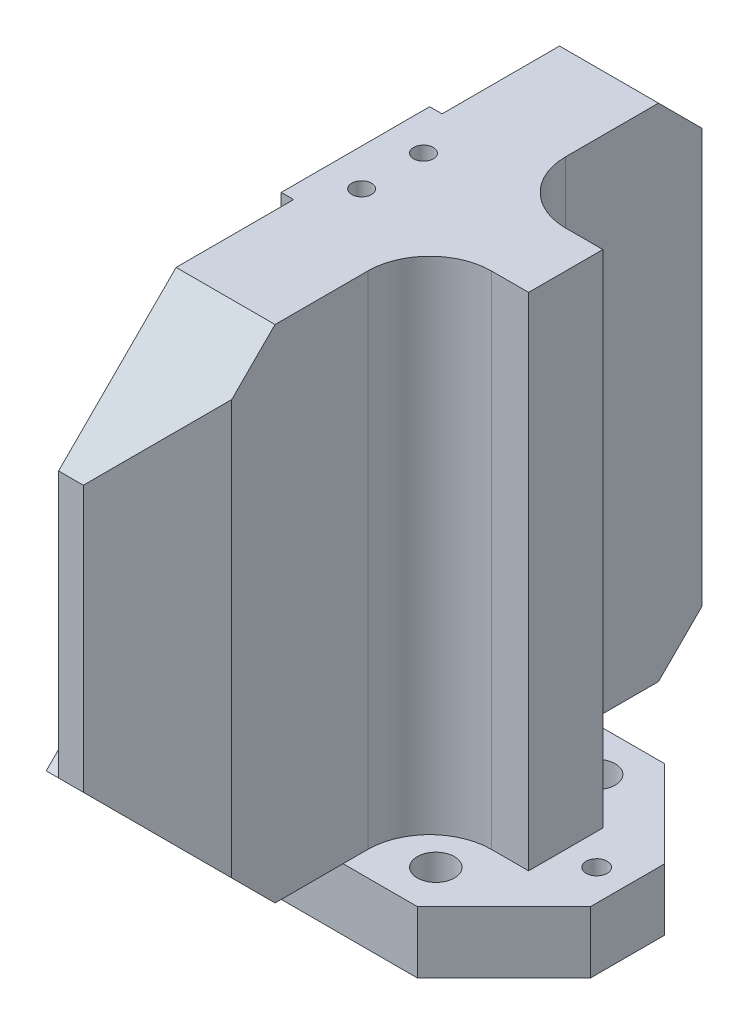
ISO-10303-21;
HEADER;
FILE_DESCRIPTION(('STEP AP214'),'2;1');
FILE_NAME('part.step','',(''),(''),'','','');
FILE_SCHEMA(('AUTOMOTIVE_DESIGN { 1 0 10303 214 1 1 1 1 }'));
ENDSEC;
DATA;
#1=APPLICATION_CONTEXT('core data for automotive mechanical design processes');
#2=APPLICATION_PROTOCOL_DEFINITION('international standard','automotive_design',2000,#1);
#3=PRODUCT_CONTEXT('',#1,'mechanical');
#4=PRODUCT('Part','Part','',(#3));
#5=PRODUCT_RELATED_PRODUCT_CATEGORY('part','',(#4));
#6=PRODUCT_DEFINITION_FORMATION('','',#4);
#7=PRODUCT_DEFINITION_CONTEXT('part definition',#1,'design');
#8=PRODUCT_DEFINITION('design','',#6,#7);
#9=PRODUCT_DEFINITION_SHAPE('','',#8);
#10=(LENGTH_UNIT() NAMED_UNIT(*) SI_UNIT(.MILLI.,.METRE.));
#11=(NAMED_UNIT(*) PLANE_ANGLE_UNIT() SI_UNIT($,.RADIAN.));
#12=(NAMED_UNIT(*) SI_UNIT($,.STERADIAN.) SOLID_ANGLE_UNIT());
#13=UNCERTAINTY_MEASURE_WITH_UNIT(LENGTH_MEASURE(1.E-05),#10,'distance_accuracy_value','');
#14=(GEOMETRIC_REPRESENTATION_CONTEXT(3) GLOBAL_UNCERTAINTY_ASSIGNED_CONTEXT((#13)) GLOBAL_UNIT_ASSIGNED_CONTEXT((#10,
#11,#12)) REPRESENTATION_CONTEXT('',''));
#15=CARTESIAN_POINT('',(0.,0.,0.));
#16=DIRECTION('',(0.,0.,1.));
#17=DIRECTION('',(1.,0.,0.));
#18=AXIS2_PLACEMENT_3D('',#15,#16,#17);
#19=CARTESIAN_POINT('',(0.,-20.,0.));
#20=DIRECTION('',(0.,1.,0.));
#21=DIRECTION('',(0.,0.,1.));
#22=AXIS2_PLACEMENT_3D('',#19,#20,#21);
#23=PLANE('',#22);
#24=CARTESIAN_POINT('',(12.,-20.,6.5));
#25=DIRECTION('',(0.,1.,0.));
#26=DIRECTION('',(0.,0.,-1.));
#27=AXIS2_PLACEMENT_3D('',#24,#25,#26);
#28=CIRCLE('',#27,1.5);
#29=CARTESIAN_POINT('',(12.,-20.,5.));
#30=VERTEX_POINT('',#29);
#31=EDGE_CURVE('E370',#30,#30,#28,.T.);
#32=ORIENTED_EDGE('',*,*,#31,.F.);
#33=EDGE_LOOP('',(#32));
#34=FACE_BOUND('',#33,.T.);
#35=CARTESIAN_POINT('',(12.,-20.,-6.5));
#36=DIRECTION('',(0.,1.,0.));
#37=DIRECTION('',(0.,0.,1.));
#38=AXIS2_PLACEMENT_3D('',#35,#36,#37);
#39=CIRCLE('',#38,1.5);
#40=CARTESIAN_POINT('',(12.,-20.,-5.));
#41=VERTEX_POINT('',#40);
#42=EDGE_CURVE('E369',#41,#41,#39,.T.);
#43=ORIENTED_EDGE('',*,*,#42,.F.);
#44=EDGE_LOOP('',(#43));
#45=FACE_BOUND('',#44,.T.);
#46=CARTESIAN_POINT('',(18.5,-20.,0.));
#47=DIRECTION('',(0.,1.,0.));
#48=DIRECTION('',(0.,0.,1.));
#49=AXIS2_PLACEMENT_3D('',#46,#47,#48);
#50=CIRCLE('',#49,0.85);
#51=CARTESIAN_POINT('',(18.5,-20.,0.85));
#52=VERTEX_POINT('',#51);
#53=EDGE_CURVE('E381',#52,#52,#50,.T.);
#54=ORIENTED_EDGE('',*,*,#53,.F.);
#55=EDGE_LOOP('',(#54));
#56=FACE_BOUND('',#55,.T.);
#57=DIRECTION('',(0.,0.,-1.));
#58=VECTOR('',#57,1.);
#59=CARTESIAN_POINT('',(21.0031457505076,-20.,0.));
#60=LINE('',#59,#58);
#61=CARTESIAN_POINT('',(21.0031457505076,-20.,3.00000000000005));
#62=VERTEX_POINT('',#61);
#63=CARTESIAN_POINT('',(21.0031457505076,-20.,-2.99999999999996));
#64=VERTEX_POINT('',#63);
#65=EDGE_CURVE('E362',#62,#64,#60,.T.);
#66=ORIENTED_EDGE('',*,*,#65,.T.);
#67=DIRECTION('',(-0.707106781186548,0.,-0.707106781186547));
#68=VECTOR('',#67,1.);
#69=CARTESIAN_POINT('',(12.0015728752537,-20.,-12.0015728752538));
#70=LINE('',#69,#68);
#71=CARTESIAN_POINT('',(14.0031457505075,-20.,-10.));
#72=VERTEX_POINT('',#71);
#73=EDGE_CURVE('E626',#64,#72,#70,.T.);
#74=ORIENTED_EDGE('',*,*,#73,.T.);
#75=DIRECTION('',(1.,0.,0.));
#76=VECTOR('',#75,1.);
#77=CARTESIAN_POINT('',(-15.,-20.,-10.));
#78=LINE('',#77,#76);
#79=CARTESIAN_POINT('',(8.,-20.,-10.));
#80=VERTEX_POINT('',#79);
#81=EDGE_CURVE('E525',#80,#72,#78,.T.);
#82=ORIENTED_EDGE('',*,*,#81,.F.);
#83=DIRECTION('',(0.,0.,-1.));
#84=VECTOR('',#83,1.);
#85=CARTESIAN_POINT('',(8.,-20.,25.));
#86=LINE('',#85,#84);
#87=CARTESIAN_POINT('',(8.,-20.,-7.99999999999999));
#88=VERTEX_POINT('',#87);
#89=EDGE_CURVE('E533',#88,#80,#86,.T.);
#90=ORIENTED_EDGE('',*,*,#89,.F.);
#91=CARTESIAN_POINT('',(13.,-20.,-7.99999999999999));
#92=DIRECTION('',(0.,1.,0.));
#93=DIRECTION('',(0.,0.,1.));
#94=AXIS2_PLACEMENT_3D('',#91,#92,#93);
#95=CIRCLE('',#94,5.);
#96=CARTESIAN_POINT('',(13.,-20.,-2.99999999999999));
#97=VERTEX_POINT('',#96);
#98=EDGE_CURVE('E301',#88,#97,#95,.T.);
#99=ORIENTED_EDGE('',*,*,#98,.T.);
#100=DIRECTION('',(-1.,0.,0.));
#101=VECTOR('',#100,1.);
#102=CARTESIAN_POINT('',(16.,-20.,-2.99999999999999));
#103=LINE('',#102,#101);
#104=CARTESIAN_POINT('',(16.,-20.,-2.99999999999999));
#105=VERTEX_POINT('',#104);
#106=EDGE_CURVE('E500',#105,#97,#103,.T.);
#107=ORIENTED_EDGE('',*,*,#106,.F.);
#108=DIRECTION('',(0.,0.,-1.));
#109=VECTOR('',#108,1.);
#110=CARTESIAN_POINT('',(16.,-20.,-2.99999999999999));
#111=LINE('',#110,#109);
#112=CARTESIAN_POINT('',(16.,-20.,3.00000000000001));
#113=VERTEX_POINT('',#112);
#114=EDGE_CURVE('E497',#113,#105,#111,.T.);
#115=ORIENTED_EDGE('',*,*,#114,.F.);
#116=DIRECTION('',(1.,0.,0.));
#117=VECTOR('',#116,1.);
#118=CARTESIAN_POINT('',(16.,-20.,3.00000000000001));
#119=LINE('',#118,#117);
#120=CARTESIAN_POINT('',(13.,-20.,3.00000000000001));
#121=VERTEX_POINT('',#120);
#122=EDGE_CURVE('E495',#121,#113,#119,.T.);
#123=ORIENTED_EDGE('',*,*,#122,.F.);
#124=CARTESIAN_POINT('',(13.,-20.,8.00000000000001));
#125=DIRECTION('',(0.,1.,0.));
#126=DIRECTION('',(0.,0.,1.));
#127=AXIS2_PLACEMENT_3D('',#124,#125,#126);
#128=CIRCLE('',#127,5.);
#129=CARTESIAN_POINT('',(8.,-20.,8.00000000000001));
#130=VERTEX_POINT('',#129);
#131=EDGE_CURVE('E304',#121,#130,#128,.T.);
#132=ORIENTED_EDGE('',*,*,#131,.T.);
#133=CARTESIAN_POINT('',(8.,-20.,10.));
#134=VERTEX_POINT('',#133);
#135=EDGE_CURVE('E532',#134,#130,#86,.T.);
#136=ORIENTED_EDGE('',*,*,#135,.F.);
#137=DIRECTION('',(-1.,0.,0.));
#138=VECTOR('',#137,1.);
#139=CARTESIAN_POINT('',(-15.,-20.,10.));
#140=LINE('',#139,#138);
#141=CARTESIAN_POINT('',(14.0031457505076,-20.,10.));
#142=VERTEX_POINT('',#141);
#143=EDGE_CURVE('E519',#142,#134,#140,.T.);
#144=ORIENTED_EDGE('',*,*,#143,.F.);
#145=DIRECTION('',(0.707106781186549,0.,-0.707106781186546));
#146=VECTOR('',#145,1.);
#147=CARTESIAN_POINT('',(12.0015728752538,-20.,12.0015728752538));
#148=LINE('',#147,#146);
#149=EDGE_CURVE('E624',#142,#62,#148,.T.);
#150=ORIENTED_EDGE('',*,*,#149,.T.);
#151=EDGE_LOOP('',(#66,#74,#82,#90,#99,#107,#115,#123,#132,#136,#144,#150));
#152=FACE_BOUND('',#151,.T.);
#153=ADVANCED_FACE('F38',(#34,#45,#56,#152),#23,.T.);
#154=CARTESIAN_POINT('',(-15.,-25.,-10.));
#155=DIRECTION('',(0.,0.,1.));
#156=DIRECTION('',(1.,0.,0.));
#157=AXIS2_PLACEMENT_3D('',#154,#155,#156);
#158=PLANE('',#157);
#159=ORIENTED_EDGE('',*,*,#81,.T.);
#160=DIRECTION('',(0.,-1.,0.));
#161=VECTOR('',#160,1.);
#162=CARTESIAN_POINT('',(14.0031457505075,-25.,-10.));
#163=LINE('',#162,#161);
#164=CARTESIAN_POINT('',(14.0031457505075,-25.,-10.));
#165=VERTEX_POINT('',#164);
#166=EDGE_CURVE('E628',#72,#165,#163,.T.);
#167=ORIENTED_EDGE('',*,*,#166,.T.);
#168=DIRECTION('',(1.,0.,0.));
#169=VECTOR('',#168,1.);
#170=CARTESIAN_POINT('',(-15.,-25.,-10.));
#171=LINE('',#170,#169);
#172=CARTESIAN_POINT('',(-6.99999999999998,-25.,-10.));
#173=VERTEX_POINT('',#172);
#174=EDGE_CURVE('E515',#173,#165,#171,.T.);
#175=ORIENTED_EDGE('',*,*,#174,.F.);
#176=DIRECTION('',(0.,1.,0.));
#177=VECTOR('',#176,1.);
#178=CARTESIAN_POINT('',(-6.99999999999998,-25.,-10.));
#179=LINE('',#178,#177);
#180=CARTESIAN_POINT('',(-6.99999999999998,-20.,-10.));
#181=VERTEX_POINT('',#180);
#182=EDGE_CURVE('E565',#173,#181,#179,.T.);
#183=ORIENTED_EDGE('',*,*,#182,.T.);
#184=CARTESIAN_POINT('',(-1.,-20.,-10.));
#185=VERTEX_POINT('',#184);
#186=EDGE_CURVE('E512',#181,#185,#78,.T.);
#187=ORIENTED_EDGE('',*,*,#186,.T.);
#188=EDGE_CURVE('E305',#185,#80,#78,.T.);
#189=ORIENTED_EDGE('',*,*,#188,.T.);
#190=EDGE_LOOP('',(#159,#167,#175,#183,#187,#189));
#191=FACE_BOUND('',#190,.T.);
#192=ADVANCED_FACE('F713',(#191),#158,.F.);
#193=CARTESIAN_POINT('',(0.,-25.,0.));
#194=DIRECTION('',(0.,1.,0.));
#195=DIRECTION('',(0.,0.,1.));
#196=AXIS2_PLACEMENT_3D('',#193,#194,#195);
#197=PLANE('',#196);
#198=CARTESIAN_POINT('',(-4.,-25.,0.));
#199=DIRECTION('',(0.,1.,0.));
#200=DIRECTION('',(0.,0.,1.));
#201=AXIS2_PLACEMENT_3D('',#198,#199,#200);
#202=CIRCLE('',#201,2.);
#203=CARTESIAN_POINT('',(-4.,-25.,2.));
#204=VERTEX_POINT('',#203);
#205=EDGE_CURVE('E354',#204,#204,#202,.T.);
#206=ORIENTED_EDGE('',*,*,#205,.T.);
#207=EDGE_LOOP('',(#206));
#208=FACE_BOUND('',#207,.T.);
#209=CARTESIAN_POINT('',(18.5,-25.,0.));
#210=DIRECTION('',(0.,1.,0.));
#211=DIRECTION('',(0.,0.,1.));
#212=AXIS2_PLACEMENT_3D('',#209,#210,#211);
#213=CIRCLE('',#212,0.85);
#214=CARTESIAN_POINT('',(18.5,-25.,0.85));
#215=VERTEX_POINT('',#214);
#216=EDGE_CURVE('E384',#215,#215,#213,.T.);
#217=ORIENTED_EDGE('',*,*,#216,.T.);
#218=EDGE_LOOP('',(#217));
#219=FACE_BOUND('',#218,.T.);
#220=CARTESIAN_POINT('',(12.,-25.,-6.5));
#221=DIRECTION('',(0.,1.,0.));
#222=DIRECTION('',(0.,0.,1.));
#223=AXIS2_PLACEMENT_3D('',#220,#221,#222);
#224=CIRCLE('',#223,1.5);
#225=CARTESIAN_POINT('',(12.,-25.,-5.));
#226=VERTEX_POINT('',#225);
#227=EDGE_CURVE('E378',#226,#226,#224,.T.);
#228=ORIENTED_EDGE('',*,*,#227,.T.);
#229=EDGE_LOOP('',(#228));
#230=FACE_BOUND('',#229,.T.);
#231=CARTESIAN_POINT('',(-12.,-25.,0.));
#232=DIRECTION('',(0.,1.,0.));
#233=DIRECTION('',(0.,0.,1.));
#234=AXIS2_PLACEMENT_3D('',#231,#232,#233);
#235=CIRCLE('',#234,1.5);
#236=CARTESIAN_POINT('',(-12.,-25.,1.5));
#237=VERTEX_POINT('',#236);
#238=EDGE_CURVE('E373',#237,#237,#235,.T.);
#239=ORIENTED_EDGE('',*,*,#238,.T.);
#240=EDGE_LOOP('',(#239));
#241=FACE_BOUND('',#240,.T.);
#242=CARTESIAN_POINT('',(12.,-25.,6.5));
#243=DIRECTION('',(0.,1.,0.));
#244=DIRECTION('',(0.,0.,-1.));
#245=AXIS2_PLACEMENT_3D('',#242,#243,#244);
#246=CIRCLE('',#245,1.5);
#247=CARTESIAN_POINT('',(12.,-25.,5.));
#248=VERTEX_POINT('',#247);
#249=EDGE_CURVE('E366',#248,#248,#246,.T.);
#250=ORIENTED_EDGE('',*,*,#249,.T.);
#251=EDGE_LOOP('',(#250));
#252=FACE_BOUND('',#251,.T.);
#253=ORIENTED_EDGE('',*,*,#174,.T.);
#254=DIRECTION('',(0.707106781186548,0.,0.707106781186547));
#255=VECTOR('',#254,1.);
#256=CARTESIAN_POINT('',(21.0031457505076,-25.,-2.99999999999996));
#257=LINE('',#256,#255);
#258=CARTESIAN_POINT('',(21.0031457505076,-25.,-2.99999999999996));
#259=VERTEX_POINT('',#258);
#260=EDGE_CURVE('E632',#165,#259,#257,.T.);
#261=ORIENTED_EDGE('',*,*,#260,.T.);
#262=DIRECTION('',(0.,0.,-1.));
#263=VECTOR('',#262,1.);
#264=CARTESIAN_POINT('',(21.0031457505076,-25.,0.));
#265=LINE('',#264,#263);
#266=CARTESIAN_POINT('',(21.0031457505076,-25.,3.00000000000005));
#267=VERTEX_POINT('',#266);
#268=EDGE_CURVE('E357',#267,#259,#265,.T.);
#269=ORIENTED_EDGE('',*,*,#268,.F.);
#270=DIRECTION('',(-0.707106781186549,0.,0.707106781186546));
#271=VECTOR('',#270,1.);
#272=CARTESIAN_POINT('',(21.0031457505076,-25.,3.00000000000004));
#273=LINE('',#272,#271);
#274=CARTESIAN_POINT('',(14.0031457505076,-25.,10.));
#275=VERTEX_POINT('',#274);
#276=EDGE_CURVE('E630',#267,#275,#273,.T.);
#277=ORIENTED_EDGE('',*,*,#276,.T.);
#278=DIRECTION('',(-1.,0.,0.));
#279=VECTOR('',#278,1.);
#280=CARTESIAN_POINT('',(-15.,-25.,10.));
#281=LINE('',#280,#279);
#282=CARTESIAN_POINT('',(-7.,-25.,10.));
#283=VERTEX_POINT('',#282);
#284=EDGE_CURVE('E509',#275,#283,#281,.T.);
#285=ORIENTED_EDGE('',*,*,#284,.T.);
#286=DIRECTION('',(0.707106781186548,0.,0.707106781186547));
#287=VECTOR('',#286,1.);
#288=CARTESIAN_POINT('',(-15.,-25.,2.00000000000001));
#289=LINE('',#288,#287);
#290=CARTESIAN_POINT('',(-15.,-25.,2.00000000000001));
#291=VERTEX_POINT('',#290);
#292=EDGE_CURVE('E578',#283,#291,#289,.F.);
#293=ORIENTED_EDGE('',*,*,#292,.T.);
#294=DIRECTION('',(0.,0.,-1.));
#295=VECTOR('',#294,1.);
#296=CARTESIAN_POINT('',(-15.,-25.,-10.));
#297=LINE('',#296,#295);
#298=CARTESIAN_POINT('',(-15.,-25.,-1.99999999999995));
#299=VERTEX_POINT('',#298);
#300=EDGE_CURVE('E511',#291,#299,#297,.T.);
#301=ORIENTED_EDGE('',*,*,#300,.T.);
#302=DIRECTION('',(-0.707106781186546,0.,0.707106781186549));
#303=VECTOR('',#302,1.);
#304=CARTESIAN_POINT('',(-6.99999999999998,-25.,-10.));
#305=LINE('',#304,#303);
#306=EDGE_CURVE('E580',#299,#173,#305,.F.);
#307=ORIENTED_EDGE('',*,*,#306,.T.);
#308=EDGE_LOOP('',(#253,#261,#269,#277,#285,#293,#301,#307));
#309=FACE_BOUND('',#308,.T.);
#310=ADVANCED_FACE('F701',(#208,#219,#230,#241,#252,#309),#197,.F.);
#311=CARTESIAN_POINT('',(-15.,-25.,10.));
#312=DIRECTION('',(0.,0.,-1.));
#313=DIRECTION('',(-1.,0.,0.));
#314=AXIS2_PLACEMENT_3D('',#311,#312,#313);
#315=PLANE('',#314);
#316=ORIENTED_EDGE('',*,*,#284,.F.);
#317=DIRECTION('',(0.,1.,0.));
#318=VECTOR('',#317,1.);
#319=CARTESIAN_POINT('',(14.0031457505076,-20.,10.));
#320=LINE('',#319,#318);
#321=EDGE_CURVE('E634',#275,#142,#320,.T.);
#322=ORIENTED_EDGE('',*,*,#321,.T.);
#323=ORIENTED_EDGE('',*,*,#143,.T.);
#324=CARTESIAN_POINT('',(-1.,-20.,10.));
#325=VERTEX_POINT('',#324);
#326=EDGE_CURVE('E522',#134,#325,#140,.T.);
#327=ORIENTED_EDGE('',*,*,#326,.T.);
#328=CARTESIAN_POINT('',(-7.,-20.,10.));
#329=VERTEX_POINT('',#328);
#330=EDGE_CURVE('E508',#325,#329,#140,.T.);
#331=ORIENTED_EDGE('',*,*,#330,.T.);
#332=DIRECTION('',(0.,-1.,0.));
#333=VECTOR('',#332,1.);
#334=CARTESIAN_POINT('',(-7.,-25.,10.));
#335=LINE('',#334,#333);
#336=EDGE_CURVE('E582',#329,#283,#335,.T.);
#337=ORIENTED_EDGE('',*,*,#336,.T.);
#338=EDGE_LOOP('',(#316,#322,#323,#327,#331,#337));
#339=FACE_BOUND('',#338,.T.);
#340=ADVANCED_FACE('F690',(#339),#315,.F.);
#341=CARTESIAN_POINT('',(0.,0.,0.));
#342=DIRECTION('',(-1.,0.,0.));
#343=DIRECTION('',(0.,0.,1.));
#344=AXIS2_PLACEMENT_3D('',#341,#342,#343);
#345=PLANE('',#344);
#346=DIRECTION('',(0.,-1.,0.));
#347=VECTOR('',#346,1.);
#348=CARTESIAN_POINT('',(0.,-20.,25.));
#349=LINE('',#348,#347);
#350=CARTESIAN_POINT('',(0.,11.,25.));
#351=VERTEX_POINT('',#350);
#352=CARTESIAN_POINT('',(0.,-10.5,25.));
#353=VERTEX_POINT('',#352);
#354=EDGE_CURVE('E535',#351,#353,#349,.T.);
#355=ORIENTED_EDGE('',*,*,#354,.F.);
#356=DIRECTION('',(0.,0.707106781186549,-0.707106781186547));
#357=VECTOR('',#356,1.);
#358=CARTESIAN_POINT('',(0.,18.,18.));
#359=LINE('',#358,#357);
#360=CARTESIAN_POINT('',(0.,20.5,15.5));
#361=VERTEX_POINT('',#360);
#362=EDGE_CURVE('E649',#351,#361,#359,.T.);
#363=ORIENTED_EDGE('',*,*,#362,.T.);
#364=DIRECTION('',(0.,0.,1.));
#365=VECTOR('',#364,1.);
#366=CARTESIAN_POINT('',(0.,20.5,25.));
#367=LINE('',#366,#365);
#368=CARTESIAN_POINT('',(0.,20.5,6.));
#369=VERTEX_POINT('',#368);
#370=EDGE_CURVE('E340',#369,#361,#367,.T.);
#371=ORIENTED_EDGE('',*,*,#370,.F.);
#372=DIRECTION('',(0.,1.,0.));
#373=VECTOR('',#372,1.);
#374=CARTESIAN_POINT('',(0.,13.,6.));
#375=LINE('',#374,#373);
#376=CARTESIAN_POINT('',(0.,13.,6.));
#377=VERTEX_POINT('',#376);
#378=EDGE_CURVE('E431',#377,#369,#375,.T.);
#379=ORIENTED_EDGE('',*,*,#378,.F.);
#380=DIRECTION('',(0.,0.,1.));
#381=VECTOR('',#380,1.);
#382=CARTESIAN_POINT('',(0.,13.,-6.));
#383=LINE('',#382,#381);
#384=CARTESIAN_POINT('',(0.,13.,-6.));
#385=VERTEX_POINT('',#384);
#386=EDGE_CURVE('E435',#385,#377,#383,.T.);
#387=ORIENTED_EDGE('',*,*,#386,.F.);
#388=DIRECTION('',(0.,-1.,0.));
#389=VECTOR('',#388,1.);
#390=CARTESIAN_POINT('',(0.,13.,-6.));
#391=LINE('',#390,#389);
#392=CARTESIAN_POINT('',(0.,20.5,-6.));
#393=VERTEX_POINT('',#392);
#394=EDGE_CURVE('E441',#393,#385,#391,.T.);
#395=ORIENTED_EDGE('',*,*,#394,.F.);
#396=DIRECTION('',(0.,0.,1.));
#397=VECTOR('',#396,1.);
#398=CARTESIAN_POINT('',(0.,20.5,-6.));
#399=LINE('',#398,#397);
#400=CARTESIAN_POINT('',(0.,20.5,-15.5));
#401=VERTEX_POINT('',#400);
#402=EDGE_CURVE('E314',#401,#393,#399,.T.);
#403=ORIENTED_EDGE('',*,*,#402,.F.);
#404=DIRECTION('',(0.,-0.707106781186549,-0.707106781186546));
#405=VECTOR('',#404,1.);
#406=CARTESIAN_POINT('',(0.,18.,-18.));
#407=LINE('',#406,#405);
#408=CARTESIAN_POINT('',(0.,11.,-25.));
#409=VERTEX_POINT('',#408);
#410=EDGE_CURVE('E647',#401,#409,#407,.T.);
#411=ORIENTED_EDGE('',*,*,#410,.T.);
#412=DIRECTION('',(0.,1.,0.));
#413=VECTOR('',#412,1.);
#414=CARTESIAN_POINT('',(0.,-20.,-25.));
#415=LINE('',#414,#413);
#416=CARTESIAN_POINT('',(0.,-10.5,-25.));
#417=VERTEX_POINT('',#416);
#418=EDGE_CURVE('E518',#417,#409,#415,.T.);
#419=ORIENTED_EDGE('',*,*,#418,.F.);
#420=DIRECTION('',(0.,-0.707106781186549,-0.707106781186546));
#421=VECTOR('',#420,1.);
#422=CARTESIAN_POINT('',(0.,-10.5,-25.));
#423=LINE('',#422,#421);
#424=CARTESIAN_POINT('',(0.,-5.55025253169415,-20.0502525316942));
#425=VERTEX_POINT('',#424);
#426=EDGE_CURVE('E454',#425,#417,#423,.T.);
#427=ORIENTED_EDGE('',*,*,#426,.F.);
#428=DIRECTION('',(0.,0.707106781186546,-0.707106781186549));
#429=VECTOR('',#428,1.);
#430=CARTESIAN_POINT('',(0.,-5.55025253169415,-20.0502525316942));
#431=LINE('',#430,#429);
#432=CARTESIAN_POINT('',(0.,-17.0710678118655,-8.52943725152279));
#433=VERTEX_POINT('',#432);
#434=EDGE_CURVE('E449',#433,#425,#431,.T.);
#435=ORIENTED_EDGE('',*,*,#434,.F.);
#436=CARTESIAN_POINT('',(0.,-10.,-1.45836943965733));
#437=DIRECTION('',(-1.,0.,0.));
#438=DIRECTION('',(0.,0.,1.));
#439=AXIS2_PLACEMENT_3D('',#436,#437,#438);
#440=CIRCLE('',#439,10.);
#441=CARTESIAN_POINT('',(0.,-20.,-1.45836943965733));
#442=VERTEX_POINT('',#441);
#443=EDGE_CURVE('E591',#433,#442,#440,.T.);
#444=ORIENTED_EDGE('',*,*,#443,.T.);
#445=DIRECTION('',(0.,0.,-1.));
#446=VECTOR('',#445,1.);
#447=CARTESIAN_POINT('',(0.,-20.,25.));
#448=LINE('',#447,#446);
#449=CARTESIAN_POINT('',(0.,-20.,1.45836943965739));
#450=VERTEX_POINT('',#449);
#451=EDGE_CURVE('E537',#450,#442,#448,.T.);
#452=ORIENTED_EDGE('',*,*,#451,.F.);
#453=CARTESIAN_POINT('',(0.,-10.,1.45836943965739));
#454=DIRECTION('',(-1.,0.,0.));
#455=DIRECTION('',(0.,0.,1.));
#456=AXIS2_PLACEMENT_3D('',#453,#454,#455);
#457=CIRCLE('',#456,10.);
#458=CARTESIAN_POINT('',(0.,-17.0710678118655,8.52943725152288));
#459=VERTEX_POINT('',#458);
#460=EDGE_CURVE('E593',#450,#459,#457,.T.);
#461=ORIENTED_EDGE('',*,*,#460,.T.);
#462=DIRECTION('',(0.,-0.707106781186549,-0.707106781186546));
#463=VECTOR('',#462,1.);
#464=CARTESIAN_POINT('',(0.,-5.55025253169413,20.0502525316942));
#465=LINE('',#464,#463);
#466=CARTESIAN_POINT('',(0.,-5.55025253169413,20.0502525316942));
#467=VERTEX_POINT('',#466);
#468=EDGE_CURVE('E476',#467,#459,#465,.T.);
#469=ORIENTED_EDGE('',*,*,#468,.F.);
#470=DIRECTION('',(0.,0.707106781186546,-0.707106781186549));
#471=VECTOR('',#470,1.);
#472=CARTESIAN_POINT('',(0.,-10.5,25.));
#473=LINE('',#472,#471);
#474=EDGE_CURVE('E471',#353,#467,#473,.T.);
#475=ORIENTED_EDGE('',*,*,#474,.F.);
#476=EDGE_LOOP('',(#355,#363,#371,#379,#387,#395,#403,#411,#419,#427,#435,#444,#452,#461,#469,#475));
#477=FACE_BOUND('',#476,.T.);
#478=ADVANCED_FACE('F655',(#477),#345,.T.);
#479=CARTESIAN_POINT('',(-4.,-20.,0.));
#480=DIRECTION('',(0.,1.,0.));
#481=DIRECTION('',(0.,0.,1.));
#482=AXIS2_PLACEMENT_3D('',#479,#480,#481);
#483=CIRCLE('',#482,2.);
#484=CARTESIAN_POINT('',(-4.,-20.,2.));
#485=VERTEX_POINT('',#484);
#486=EDGE_CURVE('E353',#485,#485,#483,.T.);
#487=ORIENTED_EDGE('',*,*,#486,.F.);
#488=EDGE_LOOP('',(#487));
#489=FACE_BOUND('',#488,.T.);
#490=CARTESIAN_POINT('',(-12.,-20.,0.));
#491=DIRECTION('',(0.,1.,0.));
#492=DIRECTION('',(0.,0.,1.));
#493=AXIS2_PLACEMENT_3D('',#490,#491,#492);
#494=CIRCLE('',#493,1.5);
#495=CARTESIAN_POINT('',(-12.,-20.,1.5));
#496=VERTEX_POINT('',#495);
#497=EDGE_CURVE('E365',#496,#496,#494,.T.);
#498=ORIENTED_EDGE('',*,*,#497,.F.);
#499=EDGE_LOOP('',(#498));
#500=FACE_BOUND('',#499,.T.);
#501=DIRECTION('',(0.,0.,1.));
#502=VECTOR('',#501,1.);
#503=CARTESIAN_POINT('',(-1.,-20.,5.60050506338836));
#504=LINE('',#503,#502);
#505=CARTESIAN_POINT('',(-1.,-20.,1.45836943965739));
#506=VERTEX_POINT('',#505);
#507=EDGE_CURVE('E482',#506,#325,#504,.T.);
#508=ORIENTED_EDGE('',*,*,#507,.F.);
#509=DIRECTION('',(1.,0.,0.));
#510=VECTOR('',#509,1.);
#511=CARTESIAN_POINT('',(0.,-20.,1.45836943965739));
#512=LINE('',#511,#510);
#513=EDGE_CURVE('E588',#506,#450,#512,.T.);
#514=ORIENTED_EDGE('',*,*,#513,.T.);
#515=ORIENTED_EDGE('',*,*,#451,.T.);
#516=DIRECTION('',(1.,0.,0.));
#517=VECTOR('',#516,1.);
#518=CARTESIAN_POINT('',(0.,-20.,-1.45836943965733));
#519=LINE('',#518,#517);
#520=CARTESIAN_POINT('',(-1.,-20.,-1.45836943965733));
#521=VERTEX_POINT('',#520);
#522=EDGE_CURVE('E585',#442,#521,#519,.F.);
#523=ORIENTED_EDGE('',*,*,#522,.T.);
#524=DIRECTION('',(0.,0.,1.));
#525=VECTOR('',#524,1.);
#526=CARTESIAN_POINT('',(-1.,-20.,-5.60050506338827));
#527=LINE('',#526,#525);
#528=EDGE_CURVE('E453',#185,#521,#527,.T.);
#529=ORIENTED_EDGE('',*,*,#528,.F.);
#530=ORIENTED_EDGE('',*,*,#186,.F.);
#531=DIRECTION('',(0.707106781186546,0.,-0.707106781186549));
#532=VECTOR('',#531,1.);
#533=CARTESIAN_POINT('',(-8.5,-20.,-8.49999999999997));
#534=LINE('',#533,#532);
#535=CARTESIAN_POINT('',(-15.,-20.,-1.99999999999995));
#536=VERTEX_POINT('',#535);
#537=EDGE_CURVE('E571',#181,#536,#534,.F.);
#538=ORIENTED_EDGE('',*,*,#537,.T.);
#539=DIRECTION('',(0.,0.,-1.));
#540=VECTOR('',#539,1.);
#541=CARTESIAN_POINT('',(-15.,-20.,-10.));
#542=LINE('',#541,#540);
#543=CARTESIAN_POINT('',(-15.,-20.,2.00000000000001));
#544=VERTEX_POINT('',#543);
#545=EDGE_CURVE('E521',#544,#536,#542,.T.);
#546=ORIENTED_EDGE('',*,*,#545,.F.);
#547=DIRECTION('',(-0.707106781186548,0.,-0.707106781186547));
#548=VECTOR('',#547,1.);
#549=CARTESIAN_POINT('',(-8.49999999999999,-20.,8.50000000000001));
#550=LINE('',#549,#548);
#551=EDGE_CURVE('E568',#544,#329,#550,.F.);
#552=ORIENTED_EDGE('',*,*,#551,.T.);
#553=ORIENTED_EDGE('',*,*,#330,.F.);
#554=EDGE_LOOP('',(#508,#514,#515,#523,#529,#530,#538,#546,#552,#553));
#555=FACE_BOUND('',#554,.T.);
#556=ADVANCED_FACE('F695',(#489,#500,#555),#23,.T.);
#557=CARTESIAN_POINT('',(8.,0.,0.));
#558=DIRECTION('',(-1.,0.,0.));
#559=DIRECTION('',(0.,0.,1.));
#560=AXIS2_PLACEMENT_3D('',#557,#558,#559);
#561=PLANE('',#560);
#562=DIRECTION('',(0.,1.,0.));
#563=VECTOR('',#562,1.);
#564=CARTESIAN_POINT('',(8.,0.,-19.));
#565=LINE('',#564,#563);
#566=CARTESIAN_POINT('',(8.,-16.5,-19.));
#567=VERTEX_POINT('',#566);
#568=CARTESIAN_POINT('',(8.,17.,-19.));
#569=VERTEX_POINT('',#568);
#570=EDGE_CURVE('E605',#567,#569,#565,.T.);
#571=ORIENTED_EDGE('',*,*,#570,.T.);
#572=DIRECTION('',(0.,0.707106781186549,0.707106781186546));
#573=VECTOR('',#572,1.);
#574=CARTESIAN_POINT('',(8.,20.5,-15.5));
#575=LINE('',#574,#573);
#576=CARTESIAN_POINT('',(8.,20.5,-15.5));
#577=VERTEX_POINT('',#576);
#578=EDGE_CURVE('E11',#569,#577,#575,.T.);
#579=ORIENTED_EDGE('',*,*,#578,.T.);
#580=DIRECTION('',(0.,0.,-1.));
#581=VECTOR('',#580,1.);
#582=CARTESIAN_POINT('',(8.,20.5,-19.));
#583=LINE('',#582,#581);
#584=CARTESIAN_POINT('',(8.,20.5,-7.99999999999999));
#585=VERTEX_POINT('',#584);
#586=EDGE_CURVE('E308',#585,#577,#583,.T.);
#587=ORIENTED_EDGE('',*,*,#586,.F.);
#588=DIRECTION('',(0.,-1.,0.));
#589=VECTOR('',#588,1.);
#590=CARTESIAN_POINT('',(8.,-20.,-7.99999999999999));
#591=LINE('',#590,#589);
#592=EDGE_CURVE('E295',#585,#88,#591,.T.);
#593=ORIENTED_EDGE('',*,*,#592,.T.);
#594=ORIENTED_EDGE('',*,*,#89,.T.);
#595=CARTESIAN_POINT('',(8.,-20.,-15.5));
#596=VERTEX_POINT('',#595);
#597=EDGE_CURVE('E540',#80,#596,#86,.T.);
#598=ORIENTED_EDGE('',*,*,#597,.T.);
#599=DIRECTION('',(0.,-0.707106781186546,0.707106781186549));
#600=VECTOR('',#599,1.);
#601=CARTESIAN_POINT('',(8.,-10.5,-25.));
#602=LINE('',#601,#600);
#603=EDGE_CURVE('E549',#596,#567,#602,.F.);
#604=ORIENTED_EDGE('',*,*,#603,.T.);
#605=EDGE_LOOP('',(#571,#579,#587,#593,#594,#598,#604));
#606=FACE_BOUND('',#605,.T.);
#607=ADVANCED_FACE('F309',(#606),#561,.F.);
#608=DIRECTION('',(0.,0.,-1.));
#609=VECTOR('',#608,1.);
#610=CARTESIAN_POINT('',(8.,20.5,8.00000000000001));
#611=LINE('',#610,#609);
#612=CARTESIAN_POINT('',(8.,20.5,15.5));
#613=VERTEX_POINT('',#612);
#614=CARTESIAN_POINT('',(8.,20.5,8.00000000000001));
#615=VERTEX_POINT('',#614);
#616=EDGE_CURVE('E342',#613,#615,#611,.T.);
#617=ORIENTED_EDGE('',*,*,#616,.F.);
#618=DIRECTION('',(0.,-0.707106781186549,0.707106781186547));
#619=VECTOR('',#618,1.);
#620=CARTESIAN_POINT('',(8.,20.5,15.5));
#621=LINE('',#620,#619);
#622=CARTESIAN_POINT('',(8.,17.,19.));
#623=VERTEX_POINT('',#622);
#624=EDGE_CURVE('E641',#613,#623,#621,.T.);
#625=ORIENTED_EDGE('',*,*,#624,.T.);
#626=DIRECTION('',(0.,-1.,0.));
#627=VECTOR('',#626,1.);
#628=CARTESIAN_POINT('',(8.,0.,19.));
#629=LINE('',#628,#627);
#630=CARTESIAN_POINT('',(8.,-16.5,19.));
#631=VERTEX_POINT('',#630);
#632=EDGE_CURVE('E611',#623,#631,#629,.T.);
#633=ORIENTED_EDGE('',*,*,#632,.T.);
#634=DIRECTION('',(0.,0.707106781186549,0.707106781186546));
#635=VECTOR('',#634,1.);
#636=CARTESIAN_POINT('',(8.,-20.,15.5));
#637=LINE('',#636,#635);
#638=CARTESIAN_POINT('',(8.,-20.,15.5));
#639=VERTEX_POINT('',#638);
#640=EDGE_CURVE('E547',#631,#639,#637,.F.);
#641=ORIENTED_EDGE('',*,*,#640,.T.);
#642=EDGE_CURVE('E528',#639,#134,#86,.T.);
#643=ORIENTED_EDGE('',*,*,#642,.T.);
#644=ORIENTED_EDGE('',*,*,#135,.T.);
#645=DIRECTION('',(0.,-1.,0.));
#646=VECTOR('',#645,1.);
#647=CARTESIAN_POINT('',(8.,20.,8.00000000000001));
#648=LINE('',#647,#646);
#649=EDGE_CURVE('E562',#130,#615,#648,.F.);
#650=ORIENTED_EDGE('',*,*,#649,.T.);
#651=EDGE_LOOP('',(#617,#625,#633,#641,#643,#644,#650));
#652=FACE_BOUND('',#651,.T.);
#653=ADVANCED_FACE('F667',(#652),#561,.F.);
#654=CARTESIAN_POINT('',(8.,-20.,25.));
#655=DIRECTION('',(0.,1.,0.));
#656=DIRECTION('',(0.,0.,1.));
#657=AXIS2_PLACEMENT_3D('',#654,#655,#656);
#658=PLANE('',#657);
#659=ORIENTED_EDGE('',*,*,#188,.F.);
#660=CARTESIAN_POINT('',(-1.,-20.,-15.5));
#661=VERTEX_POINT('',#660);
#662=EDGE_CURVE('E455',#661,#185,#527,.T.);
#663=ORIENTED_EDGE('',*,*,#662,.F.);
#664=DIRECTION('',(1.,0.,0.));
#665=VECTOR('',#664,1.);
#666=CARTESIAN_POINT('',(8.,-20.,-15.5));
#667=LINE('',#666,#665);
#668=EDGE_CURVE('E544',#661,#596,#667,.T.);
#669=ORIENTED_EDGE('',*,*,#668,.T.);
#670=ORIENTED_EDGE('',*,*,#597,.F.);
#671=EDGE_LOOP('',(#659,#663,#669,#670));
#672=FACE_BOUND('',#671,.T.);
#673=ADVANCED_FACE('F737',(#672),#658,.F.);
#674=ORIENTED_EDGE('',*,*,#326,.F.);
#675=ORIENTED_EDGE('',*,*,#642,.F.);
#676=DIRECTION('',(-1.,0.,0.));
#677=VECTOR('',#676,1.);
#678=CARTESIAN_POINT('',(8.,-20.,15.5));
#679=LINE('',#678,#677);
#680=CARTESIAN_POINT('',(-1.,-20.,15.5));
#681=VERTEX_POINT('',#680);
#682=EDGE_CURVE('E542',#639,#681,#679,.T.);
#683=ORIENTED_EDGE('',*,*,#682,.T.);
#684=EDGE_CURVE('E481',#325,#681,#504,.T.);
#685=ORIENTED_EDGE('',*,*,#684,.F.);
#686=EDGE_LOOP('',(#674,#675,#683,#685));
#687=FACE_BOUND('',#686,.T.);
#688=ADVANCED_FACE('F683',(#687),#658,.F.);
#689=CARTESIAN_POINT('',(8.,-20.,-25.));
#690=DIRECTION('',(0.,0.,1.));
#691=DIRECTION('',(1.,0.,0.));
#692=AXIS2_PLACEMENT_3D('',#689,#690,#691);
#693=PLANE('',#692);
#694=ORIENTED_EDGE('',*,*,#418,.T.);
#695=DIRECTION('',(1.,0.,0.));
#696=VECTOR('',#695,1.);
#697=CARTESIAN_POINT('',(1.99999999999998,11.,-25.));
#698=LINE('',#697,#696);
#699=CARTESIAN_POINT('',(1.99999999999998,11.,-25.));
#700=VERTEX_POINT('',#699);
#701=EDGE_CURVE('E60',#409,#700,#698,.T.);
#702=ORIENTED_EDGE('',*,*,#701,.T.);
#703=DIRECTION('',(0.,-1.,0.));
#704=VECTOR('',#703,1.);
#705=CARTESIAN_POINT('',(1.99999999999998,-20.,-25.));
#706=LINE('',#705,#704);
#707=CARTESIAN_POINT('',(1.99999999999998,-10.5,-25.));
#708=VERTEX_POINT('',#707);
#709=EDGE_CURVE('E607',#700,#708,#706,.T.);
#710=ORIENTED_EDGE('',*,*,#709,.T.);
#711=DIRECTION('',(-1.,0.,0.));
#712=VECTOR('',#711,1.);
#713=CARTESIAN_POINT('',(8.,-10.5,-25.));
#714=LINE('',#713,#712);
#715=EDGE_CURVE('E531',#708,#417,#714,.T.);
#716=ORIENTED_EDGE('',*,*,#715,.T.);
#717=EDGE_LOOP('',(#694,#702,#710,#716));
#718=FACE_BOUND('',#717,.T.);
#719=ADVANCED_FACE('F951',(#718),#693,.F.);
#720=CARTESIAN_POINT('',(8.,-20.,25.));
#721=DIRECTION('',(0.,0.,-1.));
#722=DIRECTION('',(-1.,0.,0.));
#723=AXIS2_PLACEMENT_3D('',#720,#721,#722);
#724=PLANE('',#723);
#725=DIRECTION('',(0.,1.,0.));
#726=VECTOR('',#725,1.);
#727=CARTESIAN_POINT('',(1.99999999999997,-20.,25.));
#728=LINE('',#727,#726);
#729=CARTESIAN_POINT('',(1.99999999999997,-10.5,25.));
#730=VERTEX_POINT('',#729);
#731=CARTESIAN_POINT('',(1.99999999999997,11.,25.));
#732=VERTEX_POINT('',#731);
#733=EDGE_CURVE('E615',#730,#732,#728,.T.);
#734=ORIENTED_EDGE('',*,*,#733,.T.);
#735=DIRECTION('',(-1.,0.,0.));
#736=VECTOR('',#735,1.);
#737=CARTESIAN_POINT('',(0.,11.,25.));
#738=LINE('',#737,#736);
#739=EDGE_CURVE('E645',#732,#351,#738,.T.);
#740=ORIENTED_EDGE('',*,*,#739,.T.);
#741=ORIENTED_EDGE('',*,*,#354,.T.);
#742=DIRECTION('',(1.,0.,0.));
#743=VECTOR('',#742,1.);
#744=CARTESIAN_POINT('',(8.,-10.5,25.));
#745=LINE('',#744,#743);
#746=EDGE_CURVE('E552',#353,#730,#745,.T.);
#747=ORIENTED_EDGE('',*,*,#746,.T.);
#748=EDGE_LOOP('',(#734,#740,#741,#747));
#749=FACE_BOUND('',#748,.T.);
#750=ADVANCED_FACE('F946',(#749),#724,.F.);
#751=CARTESIAN_POINT('',(8.,-10.5,-25.));
#752=DIRECTION('',(0.,0.707106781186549,0.707106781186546));
#753=DIRECTION('',(-1.,0.,0.));
#754=AXIS2_PLACEMENT_3D('',#751,#752,#753);
#755=PLANE('',#754);
#756=CARTESIAN_POINT('',(2.,-17.1715728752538,-18.3284271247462));
#757=DIRECTION('',(0.,-0.707106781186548,-0.707106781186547));
#758=DIRECTION('',(0.,0.707106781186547,-0.707106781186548));
#759=AXIS2_PLACEMENT_3D('',#756,#757,#758);
#760=CIRCLE('',#759,1.025);
#761=CARTESIAN_POINT('',(2.,-16.4467884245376,-19.0532115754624));
#762=VERTEX_POINT('',#761);
#763=EDGE_CURVE('E407',#762,#762,#760,.T.);
#764=ORIENTED_EDGE('',*,*,#763,.F.);
#765=EDGE_LOOP('',(#764));
#766=FACE_BOUND('',#765,.T.);
#767=CARTESIAN_POINT('',(2.,-13.6360389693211,-21.8639610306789));
#768=DIRECTION('',(0.,-0.707106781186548,-0.707106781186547));
#769=DIRECTION('',(0.,0.707106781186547,-0.707106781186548));
#770=AXIS2_PLACEMENT_3D('',#767,#768,#769);
#771=CIRCLE('',#770,1.025);
#772=CARTESIAN_POINT('',(2.,-12.9112545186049,-22.5887454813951));
#773=VERTEX_POINT('',#772);
#774=EDGE_CURVE('E416',#773,#773,#771,.T.);
#775=ORIENTED_EDGE('',*,*,#774,.F.);
#776=EDGE_LOOP('',(#775));
#777=FACE_BOUND('',#776,.T.);
#778=ORIENTED_EDGE('',*,*,#715,.F.);
#779=DIRECTION('',(0.577350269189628,-0.577350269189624,0.577350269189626));
#780=VECTOR('',#779,1.);
#781=CARTESIAN_POINT('',(4.,-12.5,-23.));
#782=LINE('',#781,#780);
#783=EDGE_CURVE('E609',#708,#567,#782,.T.);
#784=ORIENTED_EDGE('',*,*,#783,.T.);
#785=ORIENTED_EDGE('',*,*,#603,.F.);
#786=ORIENTED_EDGE('',*,*,#668,.F.);
#787=DIRECTION('',(0.,-0.707106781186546,0.707106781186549));
#788=VECTOR('',#787,1.);
#789=CARTESIAN_POINT('',(-1.,-20.,-15.5));
#790=LINE('',#789,#788);
#791=CARTESIAN_POINT('',(-1.,-10.5,-25.));
#792=VERTEX_POINT('',#791);
#793=EDGE_CURVE('E450',#792,#661,#790,.T.);
#794=ORIENTED_EDGE('',*,*,#793,.F.);
#795=DIRECTION('',(1.,0.,0.));
#796=VECTOR('',#795,1.);
#797=CARTESIAN_POINT('',(-1.,-10.5,-25.));
#798=LINE('',#797,#796);
#799=EDGE_CURVE('E462',#792,#417,#798,.T.);
#800=ORIENTED_EDGE('',*,*,#799,.T.);
#801=EDGE_LOOP('',(#778,#784,#785,#786,#794,#800));
#802=FACE_BOUND('',#801,.T.);
#803=ADVANCED_FACE('F741',(#766,#777,#802),#755,.F.);
#804=CARTESIAN_POINT('',(8.,-20.,15.5));
#805=DIRECTION('',(0.,0.707106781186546,-0.707106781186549));
#806=DIRECTION('',(-1.,0.,0.));
#807=AXIS2_PLACEMENT_3D('',#804,#805,#806);
#808=PLANE('',#807);
#809=CARTESIAN_POINT('',(2.,-17.1715728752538,18.3284271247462));
#810=DIRECTION('',(0.,-0.707106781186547,0.707106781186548));
#811=DIRECTION('',(0.,-0.707106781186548,-0.707106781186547));
#812=AXIS2_PLACEMENT_3D('',#809,#810,#811);
#813=CIRCLE('',#812,1.025);
#814=CARTESIAN_POINT('',(2.,-17.89635732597,17.60364267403));
#815=VERTEX_POINT('',#814);
#816=EDGE_CURVE('E387',#815,#815,#813,.T.);
#817=ORIENTED_EDGE('',*,*,#816,.F.);
#818=EDGE_LOOP('',(#817));
#819=FACE_BOUND('',#818,.T.);
#820=CARTESIAN_POINT('',(2.,-13.6360389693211,21.8639610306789));
#821=DIRECTION('',(0.,-0.707106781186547,0.707106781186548));
#822=DIRECTION('',(0.,-0.707106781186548,-0.707106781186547));
#823=AXIS2_PLACEMENT_3D('',#820,#821,#822);
#824=CIRCLE('',#823,1.025);
#825=CARTESIAN_POINT('',(2.,-14.3608234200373,21.1391765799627));
#826=VERTEX_POINT('',#825);
#827=EDGE_CURVE('E398',#826,#826,#824,.T.);
#828=ORIENTED_EDGE('',*,*,#827,.F.);
#829=EDGE_LOOP('',(#828));
#830=FACE_BOUND('',#829,.T.);
#831=ORIENTED_EDGE('',*,*,#640,.F.);
#832=DIRECTION('',(-0.577350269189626,0.577350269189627,0.577350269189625));
#833=VECTOR('',#832,1.);
#834=CARTESIAN_POINT('',(10.3333333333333,-18.8333333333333,16.6666666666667));
#835=LINE('',#834,#833);
#836=EDGE_CURVE('E613',#631,#730,#835,.T.);
#837=ORIENTED_EDGE('',*,*,#836,.T.);
#838=ORIENTED_EDGE('',*,*,#746,.F.);
#839=DIRECTION('',(1.,0.,0.));
#840=VECTOR('',#839,1.);
#841=CARTESIAN_POINT('',(-1.,-10.5,25.));
#842=LINE('',#841,#840);
#843=CARTESIAN_POINT('',(-1.,-10.5,25.));
#844=VERTEX_POINT('',#843);
#845=EDGE_CURVE('E492',#844,#353,#842,.T.);
#846=ORIENTED_EDGE('',*,*,#845,.F.);
#847=DIRECTION('',(0.,0.707106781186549,0.707106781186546));
#848=VECTOR('',#847,1.);
#849=CARTESIAN_POINT('',(-1.,-20.,15.5));
#850=LINE('',#849,#848);
#851=EDGE_CURVE('E472',#681,#844,#850,.T.);
#852=ORIENTED_EDGE('',*,*,#851,.F.);
#853=ORIENTED_EDGE('',*,*,#682,.F.);
#854=EDGE_LOOP('',(#831,#837,#838,#846,#852,#853));
#855=FACE_BOUND('',#854,.T.);
#856=ADVANCED_FACE('F676',(#819,#830,#855),#808,.F.);
#857=CARTESIAN_POINT('',(-15.,-25.,-10.));
#858=DIRECTION('',(1.,0.,0.));
#859=DIRECTION('',(0.,0.,-1.));
#860=AXIS2_PLACEMENT_3D('',#857,#858,#859);
#861=PLANE('',#860);
#862=ORIENTED_EDGE('',*,*,#545,.T.);
#863=DIRECTION('',(0.,-1.,0.));
#864=VECTOR('',#863,1.);
#865=CARTESIAN_POINT('',(-15.,-25.,-1.99999999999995));
#866=LINE('',#865,#864);
#867=EDGE_CURVE('E576',#536,#299,#866,.T.);
#868=ORIENTED_EDGE('',*,*,#867,.T.);
#869=ORIENTED_EDGE('',*,*,#300,.F.);
#870=DIRECTION('',(0.,1.,0.));
#871=VECTOR('',#870,1.);
#872=CARTESIAN_POINT('',(-15.,-25.,2.00000000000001));
#873=LINE('',#872,#871);
#874=EDGE_CURVE('E573',#291,#544,#873,.T.);
#875=ORIENTED_EDGE('',*,*,#874,.T.);
#876=EDGE_LOOP('',(#862,#868,#869,#875));
#877=FACE_BOUND('',#876,.T.);
#878=ADVANCED_FACE('F704',(#877),#861,.F.);
#879=CARTESIAN_POINT('',(16.,30.,-2.99999999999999));
#880=DIRECTION('',(0.,0.,1.));
#881=DIRECTION('',(1.,0.,0.));
#882=AXIS2_PLACEMENT_3D('',#879,#880,#881);
#883=PLANE('',#882);
#884=ORIENTED_EDGE('',*,*,#106,.T.);
#885=DIRECTION('',(0.,-1.,0.));
#886=VECTOR('',#885,1.);
#887=CARTESIAN_POINT('',(13.,20.,-2.99999999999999));
#888=LINE('',#887,#886);
#889=CARTESIAN_POINT('',(13.0000000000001,20.5,-2.99999999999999));
#890=VERTEX_POINT('',#889);
#891=EDGE_CURVE('E557',#97,#890,#888,.F.);
#892=ORIENTED_EDGE('',*,*,#891,.T.);
#893=DIRECTION('',(-1.,0.,0.));
#894=VECTOR('',#893,1.);
#895=CARTESIAN_POINT('',(13.0000000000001,20.5,-2.99999999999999));
#896=LINE('',#895,#894);
#897=CARTESIAN_POINT('',(16.,20.5,-2.99999999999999));
#898=VERTEX_POINT('',#897);
#899=EDGE_CURVE('E322',#898,#890,#896,.T.);
#900=ORIENTED_EDGE('',*,*,#899,.F.);
#901=DIRECTION('',(0.,-1.,0.));
#902=VECTOR('',#901,1.);
#903=CARTESIAN_POINT('',(16.,30.,-2.99999999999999));
#904=LINE('',#903,#902);
#905=EDGE_CURVE('E503',#898,#105,#904,.T.);
#906=ORIENTED_EDGE('',*,*,#905,.T.);
#907=EDGE_LOOP('',(#884,#892,#900,#906));
#908=FACE_BOUND('',#907,.T.);
#909=ADVANCED_FACE('F1073',(#908),#883,.F.);
#910=CARTESIAN_POINT('',(16.,30.,-2.99999999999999));
#911=DIRECTION('',(-1.,0.,0.));
#912=DIRECTION('',(0.,0.,1.));
#913=AXIS2_PLACEMENT_3D('',#910,#911,#912);
#914=PLANE('',#913);
#915=ORIENTED_EDGE('',*,*,#905,.F.);
#916=DIRECTION('',(0.,0.,-1.));
#917=VECTOR('',#916,1.);
#918=CARTESIAN_POINT('',(16.,20.5,-2.99999999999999));
#919=LINE('',#918,#917);
#920=CARTESIAN_POINT('',(16.,20.5,3.00000000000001));
#921=VERTEX_POINT('',#920);
#922=EDGE_CURVE('E350',#921,#898,#919,.T.);
#923=ORIENTED_EDGE('',*,*,#922,.F.);
#924=DIRECTION('',(0.,-1.,0.));
#925=VECTOR('',#924,1.);
#926=CARTESIAN_POINT('',(16.,30.,3.00000000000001));
#927=LINE('',#926,#925);
#928=EDGE_CURVE('E505',#921,#113,#927,.T.);
#929=ORIENTED_EDGE('',*,*,#928,.T.);
#930=ORIENTED_EDGE('',*,*,#114,.T.);
#931=EDGE_LOOP('',(#915,#923,#929,#930));
#932=FACE_BOUND('',#931,.T.);
#933=ADVANCED_FACE('F1062',(#932),#914,.F.);
#934=CARTESIAN_POINT('',(16.,30.,3.00000000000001));
#935=DIRECTION('',(0.,0.,-1.));
#936=DIRECTION('',(-1.,0.,0.));
#937=AXIS2_PLACEMENT_3D('',#934,#935,#936);
#938=PLANE('',#937);
#939=ORIENTED_EDGE('',*,*,#928,.F.);
#940=DIRECTION('',(1.,0.,0.));
#941=VECTOR('',#940,1.);
#942=CARTESIAN_POINT('',(16.,20.5,3.00000000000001));
#943=LINE('',#942,#941);
#944=CARTESIAN_POINT('',(13.,20.5,3.00000000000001));
#945=VERTEX_POINT('',#944);
#946=EDGE_CURVE('E347',#945,#921,#943,.T.);
#947=ORIENTED_EDGE('',*,*,#946,.F.);
#948=DIRECTION('',(0.,-1.,0.));
#949=VECTOR('',#948,1.);
#950=CARTESIAN_POINT('',(13.,-20.,3.00000000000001));
#951=LINE('',#950,#949);
#952=EDGE_CURVE('E559',#945,#121,#951,.T.);
#953=ORIENTED_EDGE('',*,*,#952,.T.);
#954=ORIENTED_EDGE('',*,*,#122,.T.);
#955=EDGE_LOOP('',(#939,#947,#953,#954));
#956=FACE_BOUND('',#955,.T.);
#957=ADVANCED_FACE('F1052',(#956),#938,.F.);
#958=CARTESIAN_POINT('',(13.,0.,-7.99999999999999));
#959=DIRECTION('',(0.,1.,0.));
#960=DIRECTION('',(0.,0.,1.));
#961=AXIS2_PLACEMENT_3D('',#958,#959,#960);
#962=CYLINDRICAL_SURFACE('',#961,5.);
#963=ORIENTED_EDGE('',*,*,#592,.F.);
#964=CARTESIAN_POINT('',(13.,20.5,-7.99999999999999));
#965=DIRECTION('',(0.,-1.,0.));
#966=DIRECTION('',(0.,0.,1.));
#967=AXIS2_PLACEMENT_3D('',#964,#965,#966);
#968=CIRCLE('',#967,5.);
#969=EDGE_CURVE('E300',#890,#585,#968,.T.);
#970=ORIENTED_EDGE('',*,*,#969,.F.);
#971=ORIENTED_EDGE('',*,*,#891,.F.);
#972=ORIENTED_EDGE('',*,*,#98,.F.);
#973=EDGE_LOOP('',(#963,#970,#971,#972));
#974=FACE_BOUND('',#973,.T.);
#975=ADVANCED_FACE('F297',(#974),#962,.F.);
#976=CARTESIAN_POINT('',(13.,30.,8.00000000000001));
#977=DIRECTION('',(0.,1.,0.));
#978=DIRECTION('',(0.,0.,1.));
#979=AXIS2_PLACEMENT_3D('',#976,#977,#978);
#980=CYLINDRICAL_SURFACE('',#979,5.);
#981=ORIENTED_EDGE('',*,*,#952,.F.);
#982=CARTESIAN_POINT('',(13.,20.5,8.00000000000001));
#983=DIRECTION('',(0.,-1.,0.));
#984=DIRECTION('',(0.,0.,1.));
#985=AXIS2_PLACEMENT_3D('',#982,#983,#984);
#986=CIRCLE('',#985,5.);
#987=EDGE_CURVE('E344',#615,#945,#986,.T.);
#988=ORIENTED_EDGE('',*,*,#987,.F.);
#989=ORIENTED_EDGE('',*,*,#649,.F.);
#990=ORIENTED_EDGE('',*,*,#131,.F.);
#991=EDGE_LOOP('',(#981,#988,#989,#990));
#992=FACE_BOUND('',#991,.T.);
#993=ADVANCED_FACE('F1037',(#992),#980,.F.);
#994=CARTESIAN_POINT('',(-6.99999999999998,-25.,-10.));
#995=DIRECTION('',(0.707106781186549,0.,0.707106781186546));
#996=DIRECTION('',(0.,1.,0.));
#997=AXIS2_PLACEMENT_3D('',#994,#995,#996);
#998=PLANE('',#997);
#999=ORIENTED_EDGE('',*,*,#306,.F.);
#1000=ORIENTED_EDGE('',*,*,#867,.F.);
#1001=ORIENTED_EDGE('',*,*,#537,.F.);
#1002=ORIENTED_EDGE('',*,*,#182,.F.);
#1003=EDGE_LOOP('',(#999,#1000,#1001,#1002));
#1004=FACE_BOUND('',#1003,.T.);
#1005=ADVANCED_FACE('F707',(#1004),#998,.F.);
#1006=CARTESIAN_POINT('',(-15.,-25.,2.00000000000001));
#1007=DIRECTION('',(0.707106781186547,0.,-0.707106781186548));
#1008=DIRECTION('',(0.,1.,0.));
#1009=AXIS2_PLACEMENT_3D('',#1006,#1007,#1008);
#1010=PLANE('',#1009);
#1011=ORIENTED_EDGE('',*,*,#292,.F.);
#1012=ORIENTED_EDGE('',*,*,#336,.F.);
#1013=ORIENTED_EDGE('',*,*,#551,.F.);
#1014=ORIENTED_EDGE('',*,*,#874,.F.);
#1015=EDGE_LOOP('',(#1011,#1012,#1013,#1014));
#1016=FACE_BOUND('',#1015,.T.);
#1017=ADVANCED_FACE('F698',(#1016),#1010,.F.);
#1018=CARTESIAN_POINT('',(-1.,-10.5,25.));
#1019=DIRECTION('',(0.,-0.707106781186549,-0.707106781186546));
#1020=DIRECTION('',(0.,0.707106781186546,-0.707106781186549));
#1021=AXIS2_PLACEMENT_3D('',#1018,#1019,#1020);
#1022=PLANE('',#1021);
#1023=ORIENTED_EDGE('',*,*,#474,.T.);
#1024=DIRECTION('',(1.,0.,0.));
#1025=VECTOR('',#1024,1.);
#1026=CARTESIAN_POINT('',(-1.,-5.55025253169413,20.0502525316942));
#1027=LINE('',#1026,#1025);
#1028=CARTESIAN_POINT('',(-1.,-5.55025253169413,20.0502525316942));
#1029=VERTEX_POINT('',#1028);
#1030=EDGE_CURVE('E485',#1029,#467,#1027,.T.);
#1031=ORIENTED_EDGE('',*,*,#1030,.F.);
#1032=DIRECTION('',(0.,0.707106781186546,-0.707106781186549));
#1033=VECTOR('',#1032,1.);
#1034=CARTESIAN_POINT('',(-1.,-10.5,25.));
#1035=LINE('',#1034,#1033);
#1036=EDGE_CURVE('E475',#844,#1029,#1035,.T.);
#1037=ORIENTED_EDGE('',*,*,#1036,.F.);
#1038=ORIENTED_EDGE('',*,*,#845,.T.);
#1039=EDGE_LOOP('',(#1023,#1031,#1037,#1038));
#1040=FACE_BOUND('',#1039,.T.);
#1041=ADVANCED_FACE('F1334',(#1040),#1022,.F.);
#1042=CARTESIAN_POINT('',(-1.,-5.55025253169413,20.0502525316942));
#1043=DIRECTION('',(0.,-0.707106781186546,0.707106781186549));
#1044=DIRECTION('',(0.,-0.707106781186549,-0.707106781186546));
#1045=AXIS2_PLACEMENT_3D('',#1042,#1043,#1044);
#1046=PLANE('',#1045);
#1047=ORIENTED_EDGE('',*,*,#468,.T.);
#1048=DIRECTION('',(1.,0.,0.));
#1049=VECTOR('',#1048,1.);
#1050=CARTESIAN_POINT('',(-1.,-17.0710678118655,8.52943725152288));
#1051=LINE('',#1050,#1049);
#1052=CARTESIAN_POINT('',(-1.,-17.0710678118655,8.52943725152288));
#1053=VERTEX_POINT('',#1052);
#1054=EDGE_CURVE('E595',#459,#1053,#1051,.F.);
#1055=ORIENTED_EDGE('',*,*,#1054,.T.);
#1056=DIRECTION('',(0.,-0.707106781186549,-0.707106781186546));
#1057=VECTOR('',#1056,1.);
#1058=CARTESIAN_POINT('',(-1.,-5.55025253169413,20.0502525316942));
#1059=LINE('',#1058,#1057);
#1060=EDGE_CURVE('E478',#1029,#1053,#1059,.T.);
#1061=ORIENTED_EDGE('',*,*,#1060,.F.);
#1062=ORIENTED_EDGE('',*,*,#1030,.T.);
#1063=EDGE_LOOP('',(#1047,#1055,#1061,#1062));
#1064=FACE_BOUND('',#1063,.T.);
#1065=ADVANCED_FACE('F1325',(#1064),#1046,.F.);
#1066=CARTESIAN_POINT('',(-1.,0.,0.));
#1067=DIRECTION('',(-1.,0.,0.));
#1068=DIRECTION('',(0.,0.,1.));
#1069=AXIS2_PLACEMENT_3D('',#1066,#1067,#1068);
#1070=PLANE('',#1069);
#1071=ORIENTED_EDGE('',*,*,#851,.T.);
#1072=ORIENTED_EDGE('',*,*,#1036,.T.);
#1073=ORIENTED_EDGE('',*,*,#1060,.T.);
#1074=CARTESIAN_POINT('',(-1.,-10.,1.45836943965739));
#1075=DIRECTION('',(-1.,0.,0.));
#1076=DIRECTION('',(0.,0.,1.));
#1077=AXIS2_PLACEMENT_3D('',#1074,#1075,#1076);
#1078=CIRCLE('',#1077,10.);
#1079=EDGE_CURVE('E600',#1053,#506,#1078,.F.);
#1080=ORIENTED_EDGE('',*,*,#1079,.T.);
#1081=ORIENTED_EDGE('',*,*,#507,.T.);
#1082=ORIENTED_EDGE('',*,*,#684,.T.);
#1083=EDGE_LOOP('',(#1071,#1072,#1073,#1080,#1081,#1082));
#1084=FACE_BOUND('',#1083,.T.);
#1085=ADVANCED_FACE('F1315',(#1084),#1070,.T.);
#1086=CARTESIAN_POINT('',(-1.,-5.55025253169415,-20.0502525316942));
#1087=DIRECTION('',(0.,-0.707106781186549,-0.707106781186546));
#1088=DIRECTION('',(0.,0.707106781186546,-0.707106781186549));
#1089=AXIS2_PLACEMENT_3D('',#1086,#1087,#1088);
#1090=PLANE('',#1089);
#1091=DIRECTION('',(0.,0.707106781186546,-0.707106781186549));
#1092=VECTOR('',#1091,1.);
#1093=CARTESIAN_POINT('',(-1.,-5.55025253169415,-20.0502525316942));
#1094=LINE('',#1093,#1092);
#1095=CARTESIAN_POINT('',(-1.,-17.0710678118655,-8.52943725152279));
#1096=VERTEX_POINT('',#1095);
#1097=CARTESIAN_POINT('',(-1.,-5.55025253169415,-20.0502525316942));
#1098=VERTEX_POINT('',#1097);
#1099=EDGE_CURVE('E458',#1096,#1098,#1094,.T.);
#1100=ORIENTED_EDGE('',*,*,#1099,.F.);
#1101=DIRECTION('',(1.,0.,0.));
#1102=VECTOR('',#1101,1.);
#1103=CARTESIAN_POINT('',(-1.,-17.0710678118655,-8.52943725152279));
#1104=LINE('',#1103,#1102);
#1105=EDGE_CURVE('E597',#1096,#433,#1104,.T.);
#1106=ORIENTED_EDGE('',*,*,#1105,.T.);
#1107=ORIENTED_EDGE('',*,*,#434,.T.);
#1108=DIRECTION('',(1.,0.,0.));
#1109=VECTOR('',#1108,1.);
#1110=CARTESIAN_POINT('',(-1.,-5.55025253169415,-20.0502525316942));
#1111=LINE('',#1110,#1109);
#1112=EDGE_CURVE('E468',#1098,#425,#1111,.T.);
#1113=ORIENTED_EDGE('',*,*,#1112,.F.);
#1114=EDGE_LOOP('',(#1100,#1106,#1107,#1113));
#1115=FACE_BOUND('',#1114,.T.);
#1116=ADVANCED_FACE('F1310',(#1115),#1090,.F.);
#1117=CARTESIAN_POINT('',(-1.,-10.5,-25.));
#1118=DIRECTION('',(0.,-0.707106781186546,0.707106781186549));
#1119=DIRECTION('',(0.,-0.707106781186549,-0.707106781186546));
#1120=AXIS2_PLACEMENT_3D('',#1117,#1118,#1119);
#1121=PLANE('',#1120);
#1122=ORIENTED_EDGE('',*,*,#426,.T.);
#1123=ORIENTED_EDGE('',*,*,#799,.F.);
#1124=DIRECTION('',(0.,-0.707106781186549,-0.707106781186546));
#1125=VECTOR('',#1124,1.);
#1126=CARTESIAN_POINT('',(-1.,-10.5,-25.));
#1127=LINE('',#1126,#1125);
#1128=EDGE_CURVE('E460',#1098,#792,#1127,.T.);
#1129=ORIENTED_EDGE('',*,*,#1128,.F.);
#1130=ORIENTED_EDGE('',*,*,#1112,.T.);
#1131=EDGE_LOOP('',(#1122,#1123,#1129,#1130));
#1132=FACE_BOUND('',#1131,.T.);
#1133=ADVANCED_FACE('F1301',(#1132),#1121,.F.);
#1134=CARTESIAN_POINT('',(-1.,0.,0.));
#1135=DIRECTION('',(1.,0.,0.));
#1136=DIRECTION('',(0.,0.,-1.));
#1137=AXIS2_PLACEMENT_3D('',#1134,#1135,#1136);
#1138=PLANE('',#1137);
#1139=ORIENTED_EDGE('',*,*,#793,.T.);
#1140=ORIENTED_EDGE('',*,*,#662,.T.);
#1141=ORIENTED_EDGE('',*,*,#528,.T.);
#1142=CARTESIAN_POINT('',(-1.,-10.,-1.45836943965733));
#1143=DIRECTION('',(1.,0.,0.));
#1144=DIRECTION('',(0.,0.,-1.));
#1145=AXIS2_PLACEMENT_3D('',#1142,#1143,#1144);
#1146=CIRCLE('',#1145,10.);
#1147=EDGE_CURVE('E603',#521,#1096,#1146,.T.);
#1148=ORIENTED_EDGE('',*,*,#1147,.T.);
#1149=ORIENTED_EDGE('',*,*,#1099,.T.);
#1150=ORIENTED_EDGE('',*,*,#1128,.T.);
#1151=EDGE_LOOP('',(#1139,#1140,#1141,#1148,#1149,#1150));
#1152=FACE_BOUND('',#1151,.T.);
#1153=ADVANCED_FACE('F1029',(#1152),#1138,.F.);
#1154=CARTESIAN_POINT('',(-1.,13.,6.));
#1155=DIRECTION('',(0.,0.,-1.));
#1156=DIRECTION('',(0.,1.,0.));
#1157=AXIS2_PLACEMENT_3D('',#1154,#1155,#1156);
#1158=PLANE('',#1157);
#1159=ORIENTED_EDGE('',*,*,#378,.T.);
#1160=DIRECTION('',(1.,0.,0.));
#1161=VECTOR('',#1160,1.);
#1162=CARTESIAN_POINT('',(0.,20.5,6.));
#1163=LINE('',#1162,#1161);
#1164=CARTESIAN_POINT('',(-1.,20.5,6.));
#1165=VERTEX_POINT('',#1164);
#1166=EDGE_CURVE('E337',#1165,#369,#1163,.T.);
#1167=ORIENTED_EDGE('',*,*,#1166,.F.);
#1168=DIRECTION('',(0.,1.,0.));
#1169=VECTOR('',#1168,1.);
#1170=CARTESIAN_POINT('',(-1.,13.,6.));
#1171=LINE('',#1170,#1169);
#1172=CARTESIAN_POINT('',(-1.,13.,6.));
#1173=VERTEX_POINT('',#1172);
#1174=EDGE_CURVE('E432',#1173,#1165,#1171,.T.);
#1175=ORIENTED_EDGE('',*,*,#1174,.F.);
#1176=DIRECTION('',(1.,0.,0.));
#1177=VECTOR('',#1176,1.);
#1178=CARTESIAN_POINT('',(-1.,13.,6.));
#1179=LINE('',#1178,#1177);
#1180=EDGE_CURVE('E439',#1173,#377,#1179,.T.);
#1181=ORIENTED_EDGE('',*,*,#1180,.T.);
#1182=EDGE_LOOP('',(#1159,#1167,#1175,#1181));
#1183=FACE_BOUND('',#1182,.T.);
#1184=ADVANCED_FACE('F760',(#1183),#1158,.F.);
#1185=CARTESIAN_POINT('',(-1.,13.,-6.));
#1186=DIRECTION('',(0.,0.,1.));
#1187=DIRECTION('',(1.,0.,0.));
#1188=AXIS2_PLACEMENT_3D('',#1185,#1186,#1187);
#1189=PLANE('',#1188);
#1190=ORIENTED_EDGE('',*,*,#394,.T.);
#1191=DIRECTION('',(1.,0.,0.));
#1192=VECTOR('',#1191,1.);
#1193=CARTESIAN_POINT('',(-1.,13.,-6.));
#1194=LINE('',#1193,#1192);
#1195=CARTESIAN_POINT('',(-1.,13.,-6.));
#1196=VERTEX_POINT('',#1195);
#1197=EDGE_CURVE('E446',#1196,#385,#1194,.T.);
#1198=ORIENTED_EDGE('',*,*,#1197,.F.);
#1199=DIRECTION('',(0.,-1.,0.));
#1200=VECTOR('',#1199,1.);
#1201=CARTESIAN_POINT('',(-1.,13.,-6.));
#1202=LINE('',#1201,#1200);
#1203=CARTESIAN_POINT('',(-1.,20.5,-6.));
#1204=VERTEX_POINT('',#1203);
#1205=EDGE_CURVE('E434',#1204,#1196,#1202,.T.);
#1206=ORIENTED_EDGE('',*,*,#1205,.F.);
#1207=DIRECTION('',(-1.,0.,0.));
#1208=VECTOR('',#1207,1.);
#1209=CARTESIAN_POINT('',(-1.,20.5,-6.));
#1210=LINE('',#1209,#1208);
#1211=EDGE_CURVE('E331',#393,#1204,#1210,.T.);
#1212=ORIENTED_EDGE('',*,*,#1211,.F.);
#1213=EDGE_LOOP('',(#1190,#1198,#1206,#1212));
#1214=FACE_BOUND('',#1213,.T.);
#1215=ADVANCED_FACE('F752',(#1214),#1189,.F.);
#1216=CARTESIAN_POINT('',(-1.,13.,-6.));
#1217=DIRECTION('',(0.,1.,0.));
#1218=DIRECTION('',(0.,0.,1.));
#1219=AXIS2_PLACEMENT_3D('',#1216,#1217,#1218);
#1220=PLANE('',#1219);
#1221=ORIENTED_EDGE('',*,*,#386,.T.);
#1222=ORIENTED_EDGE('',*,*,#1180,.F.);
#1223=DIRECTION('',(0.,0.,1.));
#1224=VECTOR('',#1223,1.);
#1225=CARTESIAN_POINT('',(-1.,13.,-6.));
#1226=LINE('',#1225,#1224);
#1227=EDGE_CURVE('E437',#1196,#1173,#1226,.T.);
#1228=ORIENTED_EDGE('',*,*,#1227,.F.);
#1229=ORIENTED_EDGE('',*,*,#1197,.T.);
#1230=EDGE_LOOP('',(#1221,#1222,#1228,#1229));
#1231=FACE_BOUND('',#1230,.T.);
#1232=ADVANCED_FACE('F762',(#1231),#1220,.F.);
#1233=CARTESIAN_POINT('',(-1.,0.,0.));
#1234=DIRECTION('',(1.,0.,0.));
#1235=DIRECTION('',(0.,0.,-1.));
#1236=AXIS2_PLACEMENT_3D('',#1233,#1234,#1235);
#1237=PLANE('',#1236);
#1238=ORIENTED_EDGE('',*,*,#1174,.T.);
#1239=DIRECTION('',(0.,0.,1.));
#1240=VECTOR('',#1239,1.);
#1241=CARTESIAN_POINT('',(-1.,20.5,6.));
#1242=LINE('',#1241,#1240);
#1243=EDGE_CURVE('E334',#1204,#1165,#1242,.T.);
#1244=ORIENTED_EDGE('',*,*,#1243,.F.);
#1245=ORIENTED_EDGE('',*,*,#1205,.T.);
#1246=ORIENTED_EDGE('',*,*,#1227,.T.);
#1247=EDGE_LOOP('',(#1238,#1244,#1245,#1246));
#1248=FACE_BOUND('',#1247,.T.);
#1249=ADVANCED_FACE('F755',(#1248),#1237,.F.);
#1250=CARTESIAN_POINT('',(0.,-10.,1.45836943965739));
#1251=DIRECTION('',(1.,0.,0.));
#1252=DIRECTION('',(0.,0.,-1.));
#1253=AXIS2_PLACEMENT_3D('',#1250,#1251,#1252);
#1254=CYLINDRICAL_SURFACE('',#1253,10.);
#1255=ORIENTED_EDGE('',*,*,#1079,.F.);
#1256=ORIENTED_EDGE('',*,*,#1054,.F.);
#1257=ORIENTED_EDGE('',*,*,#460,.F.);
#1258=ORIENTED_EDGE('',*,*,#513,.F.);
#1259=EDGE_LOOP('',(#1255,#1256,#1257,#1258));
#1260=FACE_BOUND('',#1259,.T.);
#1261=ADVANCED_FACE('F769',(#1260),#1254,.F.);
#1262=CARTESIAN_POINT('',(-1.,-10.,-1.45836943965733));
#1263=DIRECTION('',(1.,0.,0.));
#1264=DIRECTION('',(0.,0.,-1.));
#1265=AXIS2_PLACEMENT_3D('',#1262,#1263,#1264);
#1266=CYLINDRICAL_SURFACE('',#1265,10.);
#1267=ORIENTED_EDGE('',*,*,#1147,.F.);
#1268=ORIENTED_EDGE('',*,*,#522,.F.);
#1269=ORIENTED_EDGE('',*,*,#443,.F.);
#1270=ORIENTED_EDGE('',*,*,#1105,.F.);
#1271=EDGE_LOOP('',(#1267,#1268,#1269,#1270));
#1272=FACE_BOUND('',#1271,.T.);
#1273=ADVANCED_FACE('F939',(#1272),#1266,.F.);
#1274=CARTESIAN_POINT('',(8.,0.,-19.));
#1275=DIRECTION('',(-0.707106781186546,0.,0.707106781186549));
#1276=DIRECTION('',(0.,1.,0.));
#1277=AXIS2_PLACEMENT_3D('',#1274,#1275,#1276);
#1278=PLANE('',#1277);
#1279=ORIENTED_EDGE('',*,*,#709,.F.);
#1280=DIRECTION('',(-0.577350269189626,-0.577350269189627,-0.577350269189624));
#1281=VECTOR('',#1280,1.);
#1282=CARTESIAN_POINT('',(2.33333333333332,11.3333333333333,-24.6666666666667));
#1283=LINE('',#1282,#1281);
#1284=EDGE_CURVE('E46',#700,#569,#1283,.F.);
#1285=ORIENTED_EDGE('',*,*,#1284,.T.);
#1286=ORIENTED_EDGE('',*,*,#570,.F.);
#1287=ORIENTED_EDGE('',*,*,#783,.F.);
#1288=EDGE_LOOP('',(#1279,#1285,#1286,#1287));
#1289=FACE_BOUND('',#1288,.T.);
#1290=ADVANCED_FACE('F743',(#1289),#1278,.F.);
#1291=CARTESIAN_POINT('',(8.,0.,19.));
#1292=DIRECTION('',(-0.707106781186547,0.,-0.707106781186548));
#1293=DIRECTION('',(0.,-1.,0.));
#1294=AXIS2_PLACEMENT_3D('',#1291,#1292,#1293);
#1295=PLANE('',#1294);
#1296=ORIENTED_EDGE('',*,*,#632,.F.);
#1297=DIRECTION('',(0.577350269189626,0.577350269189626,-0.577350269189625));
#1298=VECTOR('',#1297,1.);
#1299=CARTESIAN_POINT('',(2.33333333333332,11.3333333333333,24.6666666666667));
#1300=LINE('',#1299,#1298);
#1301=EDGE_CURVE('E643',#623,#732,#1300,.F.);
#1302=ORIENTED_EDGE('',*,*,#1301,.T.);
#1303=ORIENTED_EDGE('',*,*,#733,.F.);
#1304=ORIENTED_EDGE('',*,*,#836,.F.);
#1305=EDGE_LOOP('',(#1296,#1302,#1303,#1304));
#1306=FACE_BOUND('',#1305,.T.);
#1307=ADVANCED_FACE('F670',(#1306),#1295,.F.);
#1308=CARTESIAN_POINT('',(2.,-9.39339828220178,-17.6213203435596));
#1309=DIRECTION('',(0.,-0.707106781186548,-0.707106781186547));
#1310=DIRECTION('',(0.,0.707106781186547,-0.707106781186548));
#1311=AXIS2_PLACEMENT_3D('',#1308,#1309,#1310);
#1312=CONICAL_SURFACE('',#1311,0.799999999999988,1.02974425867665);
#1313=CARTESIAN_POINT('',(2.,-9.05350018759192,-17.2814222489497));
#1314=VERTEX_POINT('',#1313);
#1315=VERTEX_LOOP('',#1314);
#1316=FACE_BOUND('',#1315,.T.);
#1317=CARTESIAN_POINT('',(2.,-9.39339828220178,-17.6213203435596));
#1318=DIRECTION('',(0.,-0.707106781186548,-0.707106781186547));
#1319=DIRECTION('',(0.,0.707106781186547,-0.707106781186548));
#1320=AXIS2_PLACEMENT_3D('',#1317,#1318,#1319);
#1321=CIRCLE('',#1320,0.799999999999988);
#1322=CARTESIAN_POINT('',(2.,-8.82771285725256,-18.1870057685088));
#1323=VERTEX_POINT('',#1322);
#1324=EDGE_CURVE('E422',#1323,#1323,#1321,.T.);
#1325=ORIENTED_EDGE('',*,*,#1324,.T.);
#1326=EDGE_LOOP('',(#1325));
#1327=FACE_BOUND('',#1326,.T.);
#1328=ADVANCED_FACE('F858',(#1316,#1327),#1312,.F.);
#1329=CARTESIAN_POINT('',(2.,-13.6360389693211,-21.8639610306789));
#1330=DIRECTION('',(0.,-0.707106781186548,-0.707106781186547));
#1331=DIRECTION('',(0.,0.707106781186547,-0.707106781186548));
#1332=AXIS2_PLACEMENT_3D('',#1329,#1330,#1331);
#1333=CYLINDRICAL_SURFACE('',#1332,0.799999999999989);
#1334=ORIENTED_EDGE('',*,*,#1324,.F.);
#1335=EDGE_LOOP('',(#1334));
#1336=FACE_BOUND('',#1335,.T.);
#1337=CARTESIAN_POINT('',(2.,-13.4769399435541,-21.7048620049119));
#1338=DIRECTION('',(0.,-0.707106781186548,-0.707106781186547));
#1339=DIRECTION('',(0.,0.707106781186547,-0.707106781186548));
#1340=AXIS2_PLACEMENT_3D('',#1337,#1338,#1339);
#1341=CIRCLE('',#1340,0.79999999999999);
#1342=CARTESIAN_POINT('',(2.,-12.9112545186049,-22.2705474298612));
#1343=VERTEX_POINT('',#1342);
#1344=EDGE_CURVE('E419',#1343,#1343,#1341,.T.);
#1345=ORIENTED_EDGE('',*,*,#1344,.T.);
#1346=EDGE_LOOP('',(#1345));
#1347=FACE_BOUND('',#1346,.T.);
#1348=ADVANCED_FACE('F854',(#1336,#1347),#1333,.F.);
#1349=CARTESIAN_POINT('',(2.,-13.6360389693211,-21.8639610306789));
#1350=DIRECTION('',(0.,-0.707106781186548,-0.707106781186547));
#1351=DIRECTION('',(0.,0.707106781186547,-0.707106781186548));
#1352=AXIS2_PLACEMENT_3D('',#1349,#1350,#1351);
#1353=CONICAL_SURFACE('',#1352,1.025,0.785398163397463);
#1354=ORIENTED_EDGE('',*,*,#1344,.F.);
#1355=EDGE_LOOP('',(#1354));
#1356=FACE_BOUND('',#1355,.T.);
#1357=ORIENTED_EDGE('',*,*,#774,.T.);
#1358=EDGE_LOOP('',(#1357));
#1359=FACE_BOUND('',#1358,.T.);
#1360=ADVANCED_FACE('F850',(#1356,#1359),#1353,.F.);
#1361=CARTESIAN_POINT('',(2.,-12.9289321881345,-14.0857864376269));
#1362=DIRECTION('',(0.,-0.707106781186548,-0.707106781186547));
#1363=DIRECTION('',(0.,0.707106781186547,-0.707106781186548));
#1364=AXIS2_PLACEMENT_3D('',#1361,#1362,#1363);
#1365=CONICAL_SURFACE('',#1364,0.799999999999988,1.02974425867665);
#1366=CARTESIAN_POINT('',(2.,-12.5890340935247,-13.745888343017));
#1367=VERTEX_POINT('',#1366);
#1368=VERTEX_LOOP('',#1367);
#1369=FACE_BOUND('',#1368,.T.);
#1370=CARTESIAN_POINT('',(2.,-12.9289321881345,-14.0857864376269));
#1371=DIRECTION('',(0.,-0.707106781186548,-0.707106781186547));
#1372=DIRECTION('',(0.,0.707106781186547,-0.707106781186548));
#1373=AXIS2_PLACEMENT_3D('',#1370,#1371,#1372);
#1374=CIRCLE('',#1373,0.799999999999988);
#1375=CARTESIAN_POINT('',(2.,-12.3632467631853,-14.6514718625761));
#1376=VERTEX_POINT('',#1375);
#1377=EDGE_CURVE('E413',#1376,#1376,#1374,.T.);
#1378=ORIENTED_EDGE('',*,*,#1377,.T.);
#1379=EDGE_LOOP('',(#1378));
#1380=FACE_BOUND('',#1379,.T.);
#1381=ADVANCED_FACE('F846',(#1369,#1380),#1365,.F.);
#1382=CARTESIAN_POINT('',(2.,-17.1715728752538,-18.3284271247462));
#1383=DIRECTION('',(0.,-0.707106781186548,-0.707106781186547));
#1384=DIRECTION('',(0.,0.707106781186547,-0.707106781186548));
#1385=AXIS2_PLACEMENT_3D('',#1382,#1383,#1384);
#1386=CYLINDRICAL_SURFACE('',#1385,0.799999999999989);
#1387=ORIENTED_EDGE('',*,*,#1377,.F.);
#1388=EDGE_LOOP('',(#1387));
#1389=FACE_BOUND('',#1388,.T.);
#1390=CARTESIAN_POINT('',(2.,-17.0124738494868,-18.1693280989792));
#1391=DIRECTION('',(0.,-0.707106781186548,-0.707106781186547));
#1392=DIRECTION('',(0.,0.707106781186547,-0.707106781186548));
#1393=AXIS2_PLACEMENT_3D('',#1390,#1391,#1392);
#1394=CIRCLE('',#1393,0.79999999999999);
#1395=CARTESIAN_POINT('',(2.,-16.4467884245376,-18.7350135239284));
#1396=VERTEX_POINT('',#1395);
#1397=EDGE_CURVE('E410',#1396,#1396,#1394,.T.);
#1398=ORIENTED_EDGE('',*,*,#1397,.T.);
#1399=EDGE_LOOP('',(#1398));
#1400=FACE_BOUND('',#1399,.T.);
#1401=ADVANCED_FACE('F842',(#1389,#1400),#1386,.F.);
#1402=CARTESIAN_POINT('',(2.,-17.1715728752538,-18.3284271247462));
#1403=DIRECTION('',(0.,-0.707106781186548,-0.707106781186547));
#1404=DIRECTION('',(0.,0.707106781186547,-0.707106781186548));
#1405=AXIS2_PLACEMENT_3D('',#1402,#1403,#1404);
#1406=CONICAL_SURFACE('',#1405,1.025,0.785398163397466);
#1407=ORIENTED_EDGE('',*,*,#1397,.F.);
#1408=EDGE_LOOP('',(#1407));
#1409=FACE_BOUND('',#1408,.T.);
#1410=ORIENTED_EDGE('',*,*,#763,.T.);
#1411=EDGE_LOOP('',(#1410));
#1412=FACE_BOUND('',#1411,.T.);
#1413=ADVANCED_FACE('F838',(#1409,#1412),#1406,.F.);
#1414=CARTESIAN_POINT('',(2.,-9.39339828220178,17.6213203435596));
#1415=DIRECTION('',(0.,-0.707106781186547,0.707106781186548));
#1416=DIRECTION('',(0.,-0.707106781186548,-0.707106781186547));
#1417=AXIS2_PLACEMENT_3D('',#1414,#1415,#1416);
#1418=CONICAL_SURFACE('',#1417,0.799999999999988,1.02974425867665);
#1419=CARTESIAN_POINT('',(2.,-9.05350018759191,17.2814222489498));
#1420=VERTEX_POINT('',#1419);
#1421=VERTEX_LOOP('',#1420);
#1422=FACE_BOUND('',#1421,.T.);
#1423=CARTESIAN_POINT('',(2.,-9.39339828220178,17.6213203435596));
#1424=DIRECTION('',(0.,-0.707106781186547,0.707106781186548));
#1425=DIRECTION('',(0.,-0.707106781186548,-0.707106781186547));
#1426=AXIS2_PLACEMENT_3D('',#1423,#1424,#1425);
#1427=CIRCLE('',#1426,0.799999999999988);
#1428=CARTESIAN_POINT('',(2.,-9.95908370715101,17.0556349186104));
#1429=VERTEX_POINT('',#1428);
#1430=EDGE_CURVE('E404',#1429,#1429,#1427,.T.);
#1431=ORIENTED_EDGE('',*,*,#1430,.T.);
#1432=EDGE_LOOP('',(#1431));
#1433=FACE_BOUND('',#1432,.T.);
#1434=ADVANCED_FACE('F834',(#1422,#1433),#1418,.F.);
#1435=CARTESIAN_POINT('',(2.,-13.6360389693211,21.8639610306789));
#1436=DIRECTION('',(0.,-0.707106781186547,0.707106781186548));
#1437=DIRECTION('',(0.,-0.707106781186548,-0.707106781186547));
#1438=AXIS2_PLACEMENT_3D('',#1435,#1436,#1437);
#1439=CYLINDRICAL_SURFACE('',#1438,0.799999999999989);
#1440=ORIENTED_EDGE('',*,*,#1430,.F.);
#1441=EDGE_LOOP('',(#1440));
#1442=FACE_BOUND('',#1441,.T.);
#1443=CARTESIAN_POINT('',(2.,-13.4769399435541,21.7048620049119));
#1444=DIRECTION('',(0.,-0.707106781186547,0.707106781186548));
#1445=DIRECTION('',(0.,-0.707106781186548,-0.707106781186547));
#1446=AXIS2_PLACEMENT_3D('',#1443,#1444,#1445);
#1447=CIRCLE('',#1446,0.79999999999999);
#1448=CARTESIAN_POINT('',(2.,-14.0426253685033,21.1391765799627));
#1449=VERTEX_POINT('',#1448);
#1450=EDGE_CURVE('E401',#1449,#1449,#1447,.T.);
#1451=ORIENTED_EDGE('',*,*,#1450,.T.);
#1452=EDGE_LOOP('',(#1451));
#1453=FACE_BOUND('',#1452,.T.);
#1454=ADVANCED_FACE('F830',(#1442,#1453),#1439,.F.);
#1455=CARTESIAN_POINT('',(2.,-13.6360389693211,21.8639610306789));
#1456=DIRECTION('',(0.,-0.707106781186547,0.707106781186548));
#1457=DIRECTION('',(0.,-0.707106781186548,-0.707106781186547));
#1458=AXIS2_PLACEMENT_3D('',#1455,#1456,#1457);
#1459=CONICAL_SURFACE('',#1458,1.025,0.785398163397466);
#1460=ORIENTED_EDGE('',*,*,#1450,.F.);
#1461=EDGE_LOOP('',(#1460));
#1462=FACE_BOUND('',#1461,.T.);
#1463=ORIENTED_EDGE('',*,*,#827,.T.);
#1464=EDGE_LOOP('',(#1463));
#1465=FACE_BOUND('',#1464,.T.);
#1466=ADVANCED_FACE('F826',(#1462,#1465),#1459,.F.);
#1467=CARTESIAN_POINT('',(2.,-12.9289321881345,14.0857864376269));
#1468=DIRECTION('',(0.,-0.707106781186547,0.707106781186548));
#1469=DIRECTION('',(0.,-0.707106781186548,-0.707106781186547));
#1470=AXIS2_PLACEMENT_3D('',#1467,#1468,#1469);
#1471=CONICAL_SURFACE('',#1470,0.799999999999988,1.02974425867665);
#1472=CARTESIAN_POINT('',(2.,-12.5890340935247,13.745888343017));
#1473=VERTEX_POINT('',#1472);
#1474=VERTEX_LOOP('',#1473);
#1475=FACE_BOUND('',#1474,.T.);
#1476=CARTESIAN_POINT('',(2.,-12.9289321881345,14.0857864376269));
#1477=DIRECTION('',(0.,-0.707106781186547,0.707106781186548));
#1478=DIRECTION('',(0.,-0.707106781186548,-0.707106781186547));
#1479=AXIS2_PLACEMENT_3D('',#1476,#1477,#1478);
#1480=CIRCLE('',#1479,0.799999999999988);
#1481=CARTESIAN_POINT('',(2.,-13.4946176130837,13.5201010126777));
#1482=VERTEX_POINT('',#1481);
#1483=EDGE_CURVE('E395',#1482,#1482,#1480,.T.);
#1484=ORIENTED_EDGE('',*,*,#1483,.T.);
#1485=EDGE_LOOP('',(#1484));
#1486=FACE_BOUND('',#1485,.T.);
#1487=ADVANCED_FACE('F822',(#1475,#1486),#1471,.F.);
#1488=CARTESIAN_POINT('',(2.,-17.1715728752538,18.3284271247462));
#1489=DIRECTION('',(0.,-0.707106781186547,0.707106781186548));
#1490=DIRECTION('',(0.,-0.707106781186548,-0.707106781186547));
#1491=AXIS2_PLACEMENT_3D('',#1488,#1489,#1490);
#1492=CYLINDRICAL_SURFACE('',#1491,0.799999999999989);
#1493=ORIENTED_EDGE('',*,*,#1483,.F.);
#1494=EDGE_LOOP('',(#1493));
#1495=FACE_BOUND('',#1494,.T.);
#1496=CARTESIAN_POINT('',(2.,-17.0124738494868,18.1693280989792));
#1497=DIRECTION('',(0.,-0.707106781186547,0.707106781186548));
#1498=DIRECTION('',(0.,-0.707106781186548,-0.707106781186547));
#1499=AXIS2_PLACEMENT_3D('',#1496,#1497,#1498);
#1500=CIRCLE('',#1499,0.79999999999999);
#1501=CARTESIAN_POINT('',(2.,-17.5781592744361,17.60364267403));
#1502=VERTEX_POINT('',#1501);
#1503=EDGE_CURVE('E392',#1502,#1502,#1500,.T.);
#1504=ORIENTED_EDGE('',*,*,#1503,.T.);
#1505=EDGE_LOOP('',(#1504));
#1506=FACE_BOUND('',#1505,.T.);
#1507=ADVANCED_FACE('F818',(#1495,#1506),#1492,.F.);
#1508=CARTESIAN_POINT('',(2.,-17.1715728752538,18.3284271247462));
#1509=DIRECTION('',(0.,-0.707106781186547,0.707106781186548));
#1510=DIRECTION('',(0.,-0.707106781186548,-0.707106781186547));
#1511=AXIS2_PLACEMENT_3D('',#1508,#1509,#1510);
#1512=CONICAL_SURFACE('',#1511,1.025,0.785398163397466);
#1513=ORIENTED_EDGE('',*,*,#1503,.F.);
#1514=EDGE_LOOP('',(#1513));
#1515=FACE_BOUND('',#1514,.T.);
#1516=ORIENTED_EDGE('',*,*,#816,.T.);
#1517=EDGE_LOOP('',(#1516));
#1518=FACE_BOUND('',#1517,.T.);
#1519=ADVANCED_FACE('F814',(#1515,#1518),#1512,.F.);
#1520=CARTESIAN_POINT('',(18.5,-25.,0.));
#1521=DIRECTION('',(0.,1.,0.));
#1522=DIRECTION('',(0.,0.,1.));
#1523=AXIS2_PLACEMENT_3D('',#1520,#1521,#1522);
#1524=CYLINDRICAL_SURFACE('',#1523,0.85);
#1525=ORIENTED_EDGE('',*,*,#216,.F.);
#1526=EDGE_LOOP('',(#1525));
#1527=FACE_BOUND('',#1526,.T.);
#1528=ORIENTED_EDGE('',*,*,#53,.T.);
#1529=EDGE_LOOP('',(#1528));
#1530=FACE_BOUND('',#1529,.T.);
#1531=ADVANCED_FACE('F806',(#1527,#1530),#1524,.F.);
#1532=CARTESIAN_POINT('',(12.,-25.,-6.5));
#1533=DIRECTION('',(0.,1.,0.));
#1534=DIRECTION('',(0.,0.,1.));
#1535=AXIS2_PLACEMENT_3D('',#1532,#1533,#1534);
#1536=CYLINDRICAL_SURFACE('',#1535,1.5);
#1537=ORIENTED_EDGE('',*,*,#227,.F.);
#1538=EDGE_LOOP('',(#1537));
#1539=FACE_BOUND('',#1538,.T.);
#1540=ORIENTED_EDGE('',*,*,#42,.T.);
#1541=EDGE_LOOP('',(#1540));
#1542=FACE_BOUND('',#1541,.T.);
#1543=ADVANCED_FACE('F797',(#1539,#1542),#1536,.F.);
#1544=CARTESIAN_POINT('',(-12.,-25.,0.));
#1545=DIRECTION('',(0.,1.,0.));
#1546=DIRECTION('',(0.,0.,1.));
#1547=AXIS2_PLACEMENT_3D('',#1544,#1545,#1546);
#1548=CYLINDRICAL_SURFACE('',#1547,1.5);
#1549=ORIENTED_EDGE('',*,*,#238,.F.);
#1550=EDGE_LOOP('',(#1549));
#1551=FACE_BOUND('',#1550,.T.);
#1552=ORIENTED_EDGE('',*,*,#497,.T.);
#1553=EDGE_LOOP('',(#1552));
#1554=FACE_BOUND('',#1553,.T.);
#1555=ADVANCED_FACE('F794',(#1551,#1554),#1548,.F.);
#1556=CARTESIAN_POINT('',(12.,-25.,6.5));
#1557=DIRECTION('',(0.,1.,0.));
#1558=DIRECTION('',(0.,0.,1.));
#1559=AXIS2_PLACEMENT_3D('',#1556,#1557,#1558);
#1560=CYLINDRICAL_SURFACE('',#1559,1.5);
#1561=ORIENTED_EDGE('',*,*,#249,.F.);
#1562=EDGE_LOOP('',(#1561));
#1563=FACE_BOUND('',#1562,.T.);
#1564=ORIENTED_EDGE('',*,*,#31,.T.);
#1565=EDGE_LOOP('',(#1564));
#1566=FACE_BOUND('',#1565,.T.);
#1567=ADVANCED_FACE('F796',(#1563,#1566),#1560,.F.);
#1568=CARTESIAN_POINT('',(21.0031457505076,-22.9792323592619,0.));
#1569=DIRECTION('',(1.,0.,0.));
#1570=DIRECTION('',(0.,0.,-1.));
#1571=AXIS2_PLACEMENT_3D('',#1568,#1569,#1570);
#1572=PLANE('',#1571);
#1573=ORIENTED_EDGE('',*,*,#268,.T.);
#1574=DIRECTION('',(0.,1.,0.));
#1575=VECTOR('',#1574,1.);
#1576=CARTESIAN_POINT('',(21.0031457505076,-20.,-2.99999999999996));
#1577=LINE('',#1576,#1575);
#1578=EDGE_CURVE('E621',#259,#64,#1577,.T.);
#1579=ORIENTED_EDGE('',*,*,#1578,.T.);
#1580=ORIENTED_EDGE('',*,*,#65,.F.);
#1581=DIRECTION('',(0.,-1.,0.));
#1582=VECTOR('',#1581,1.);
#1583=CARTESIAN_POINT('',(21.0031457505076,-25.,3.00000000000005));
#1584=LINE('',#1583,#1582);
#1585=EDGE_CURVE('E618',#62,#267,#1584,.T.);
#1586=ORIENTED_EDGE('',*,*,#1585,.T.);
#1587=EDGE_LOOP('',(#1573,#1579,#1580,#1586));
#1588=FACE_BOUND('',#1587,.T.);
#1589=ADVANCED_FACE('F722',(#1588),#1572,.T.);
#1590=CARTESIAN_POINT('',(21.0031457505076,-22.9792323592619,-2.99999999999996));
#1591=DIRECTION('',(0.707106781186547,0.,-0.707106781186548));
#1592=DIRECTION('',(0.,-1.,0.));
#1593=AXIS2_PLACEMENT_3D('',#1590,#1591,#1592);
#1594=PLANE('',#1593);
#1595=ORIENTED_EDGE('',*,*,#260,.F.);
#1596=ORIENTED_EDGE('',*,*,#166,.F.);
#1597=ORIENTED_EDGE('',*,*,#73,.F.);
#1598=ORIENTED_EDGE('',*,*,#1578,.F.);
#1599=EDGE_LOOP('',(#1595,#1596,#1597,#1598));
#1600=FACE_BOUND('',#1599,.T.);
#1601=ADVANCED_FACE('F718',(#1600),#1594,.T.);
#1602=CARTESIAN_POINT('',(21.0031457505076,-22.9792323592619,3.00000000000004));
#1603=DIRECTION('',(0.707106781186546,0.,0.707106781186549));
#1604=DIRECTION('',(0.,1.,0.));
#1605=AXIS2_PLACEMENT_3D('',#1602,#1603,#1604);
#1606=PLANE('',#1605);
#1607=ORIENTED_EDGE('',*,*,#149,.F.);
#1608=ORIENTED_EDGE('',*,*,#321,.F.);
#1609=ORIENTED_EDGE('',*,*,#276,.F.);
#1610=ORIENTED_EDGE('',*,*,#1585,.F.);
#1611=EDGE_LOOP('',(#1607,#1608,#1609,#1610));
#1612=FACE_BOUND('',#1611,.T.);
#1613=ADVANCED_FACE('F727',(#1612),#1606,.T.);
#1614=CARTESIAN_POINT('',(-4.,-25.,0.));
#1615=DIRECTION('',(0.,1.,0.));
#1616=DIRECTION('',(0.,0.,1.));
#1617=AXIS2_PLACEMENT_3D('',#1614,#1615,#1616);
#1618=CYLINDRICAL_SURFACE('',#1617,2.);
#1619=ORIENTED_EDGE('',*,*,#205,.F.);
#1620=EDGE_LOOP('',(#1619));
#1621=FACE_BOUND('',#1620,.T.);
#1622=ORIENTED_EDGE('',*,*,#486,.T.);
#1623=EDGE_LOOP('',(#1622));
#1624=FACE_BOUND('',#1623,.T.);
#1625=ADVANCED_FACE('F881',(#1621,#1624),#1618,.F.);
#1626=CARTESIAN_POINT('',(13.,20.5,-7.99999999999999));
#1627=DIRECTION('',(0.,1.,0.));
#1628=DIRECTION('',(0.,0.,1.));
#1629=AXIS2_PLACEMENT_3D('',#1626,#1627,#1628);
#1630=PLANE('',#1629);
#1631=CARTESIAN_POINT('',(2.,20.5,-2.5));
#1632=DIRECTION('',(0.,1.,0.));
#1633=DIRECTION('',(0.,0.,1.));
#1634=AXIS2_PLACEMENT_3D('',#1631,#1632,#1633);
#1635=CIRCLE('',#1634,0.79999999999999);
#1636=CARTESIAN_POINT('',(2.,20.5,-1.70000000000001));
#1637=VERTEX_POINT('',#1636);
#1638=EDGE_CURVE('E323',#1637,#1637,#1635,.T.);
#1639=ORIENTED_EDGE('',*,*,#1638,.F.);
#1640=EDGE_LOOP('',(#1639));
#1641=FACE_BOUND('',#1640,.T.);
#1642=ORIENTED_EDGE('',*,*,#370,.T.);
#1643=DIRECTION('',(1.,0.,0.));
#1644=VECTOR('',#1643,1.);
#1645=CARTESIAN_POINT('',(1.99999999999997,20.5,15.5));
#1646=LINE('',#1645,#1644);
#1647=EDGE_CURVE('E638',#361,#613,#1646,.T.);
#1648=ORIENTED_EDGE('',*,*,#1647,.T.);
#1649=ORIENTED_EDGE('',*,*,#616,.T.);
#1650=ORIENTED_EDGE('',*,*,#987,.T.);
#1651=ORIENTED_EDGE('',*,*,#946,.T.);
#1652=ORIENTED_EDGE('',*,*,#922,.T.);
#1653=ORIENTED_EDGE('',*,*,#899,.T.);
#1654=ORIENTED_EDGE('',*,*,#969,.T.);
#1655=ORIENTED_EDGE('',*,*,#586,.T.);
#1656=DIRECTION('',(-1.,0.,0.));
#1657=VECTOR('',#1656,1.);
#1658=CARTESIAN_POINT('',(0.,20.5,-15.5));
#1659=LINE('',#1658,#1657);
#1660=EDGE_CURVE('E636',#577,#401,#1659,.T.);
#1661=ORIENTED_EDGE('',*,*,#1660,.T.);
#1662=ORIENTED_EDGE('',*,*,#402,.T.);
#1663=ORIENTED_EDGE('',*,*,#1211,.T.);
#1664=ORIENTED_EDGE('',*,*,#1243,.T.);
#1665=ORIENTED_EDGE('',*,*,#1166,.T.);
#1666=EDGE_LOOP('',(#1642,#1648,#1649,#1650,#1651,#1652,#1653,#1654,#1655,#1661,#1662,#1663,
#1664,#1665));
#1667=FACE_BOUND('',#1666,.T.);
#1668=CARTESIAN_POINT('',(2.,20.5,2.5));
#1669=DIRECTION('',(0.,1.,0.));
#1670=DIRECTION('',(0.,0.,1.));
#1671=AXIS2_PLACEMENT_3D('',#1668,#1669,#1670);
#1672=CIRCLE('',#1671,0.79999999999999);
#1673=CARTESIAN_POINT('',(2.,20.5,3.29999999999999));
#1674=VERTEX_POINT('',#1673);
#1675=EDGE_CURVE('E326',#1674,#1674,#1672,.T.);
#1676=ORIENTED_EDGE('',*,*,#1675,.F.);
#1677=EDGE_LOOP('',(#1676));
#1678=FACE_BOUND('',#1677,.T.);
#1679=ADVANCED_FACE('F318',(#1641,#1667,#1678),#1630,.T.);
#1680=CARTESIAN_POINT('',(2.,14.,2.5));
#1681=DIRECTION('',(0.,1.,0.));
#1682=DIRECTION('',(0.,0.,1.));
#1683=AXIS2_PLACEMENT_3D('',#1680,#1681,#1682);
#1684=CONICAL_SURFACE('',#1683,0.799999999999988,1.02974425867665);
#1685=CARTESIAN_POINT('',(2.,13.519311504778,2.5));
#1686=VERTEX_POINT('',#1685);
#1687=VERTEX_LOOP('',#1686);
#1688=FACE_BOUND('',#1687,.T.);
#1689=CARTESIAN_POINT('',(2.,14.,2.5));
#1690=DIRECTION('',(0.,1.,0.));
#1691=DIRECTION('',(0.,0.,1.));
#1692=AXIS2_PLACEMENT_3D('',#1689,#1690,#1691);
#1693=CIRCLE('',#1692,0.799999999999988);
#1694=CARTESIAN_POINT('',(2.,14.,3.29999999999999));
#1695=VERTEX_POINT('',#1694);
#1696=EDGE_CURVE('E428',#1695,#1695,#1693,.T.);
#1697=ORIENTED_EDGE('',*,*,#1696,.T.);
#1698=EDGE_LOOP('',(#1697));
#1699=FACE_BOUND('',#1698,.T.);
#1700=ADVANCED_FACE('F874',(#1688,#1699),#1684,.F.);
#1701=CARTESIAN_POINT('',(2.,20.,2.5));
#1702=DIRECTION('',(0.,1.,0.));
#1703=DIRECTION('',(0.,0.,1.));
#1704=AXIS2_PLACEMENT_3D('',#1701,#1702,#1703);
#1705=CYLINDRICAL_SURFACE('',#1704,0.799999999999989);
#1706=ORIENTED_EDGE('',*,*,#1696,.F.);
#1707=EDGE_LOOP('',(#1706));
#1708=FACE_BOUND('',#1707,.T.);
#1709=ORIENTED_EDGE('',*,*,#1675,.T.);
#1710=EDGE_LOOP('',(#1709));
#1711=FACE_BOUND('',#1710,.T.);
#1712=ADVANCED_FACE('F870',(#1708,#1711),#1705,.F.);
#1713=CARTESIAN_POINT('',(2.,14.,-2.5));
#1714=DIRECTION('',(0.,1.,0.));
#1715=DIRECTION('',(0.,0.,1.));
#1716=AXIS2_PLACEMENT_3D('',#1713,#1714,#1715);
#1717=CONICAL_SURFACE('',#1716,0.799999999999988,1.02974425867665);
#1718=CARTESIAN_POINT('',(2.,13.519311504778,-2.5));
#1719=VERTEX_POINT('',#1718);
#1720=VERTEX_LOOP('',#1719);
#1721=FACE_BOUND('',#1720,.T.);
#1722=CARTESIAN_POINT('',(2.,14.,-2.5));
#1723=DIRECTION('',(0.,1.,0.));
#1724=DIRECTION('',(0.,0.,1.));
#1725=AXIS2_PLACEMENT_3D('',#1722,#1723,#1724);
#1726=CIRCLE('',#1725,0.799999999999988);
#1727=CARTESIAN_POINT('',(2.,14.,-1.70000000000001));
#1728=VERTEX_POINT('',#1727);
#1729=EDGE_CURVE('E425',#1728,#1728,#1726,.T.);
#1730=ORIENTED_EDGE('',*,*,#1729,.T.);
#1731=EDGE_LOOP('',(#1730));
#1732=FACE_BOUND('',#1731,.T.);
#1733=ADVANCED_FACE('F866',(#1721,#1732),#1717,.F.);
#1734=CARTESIAN_POINT('',(2.,20.,-2.5));
#1735=DIRECTION('',(0.,1.,0.));
#1736=DIRECTION('',(0.,0.,1.));
#1737=AXIS2_PLACEMENT_3D('',#1734,#1735,#1736);
#1738=CYLINDRICAL_SURFACE('',#1737,0.799999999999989);
#1739=ORIENTED_EDGE('',*,*,#1729,.F.);
#1740=EDGE_LOOP('',(#1739));
#1741=FACE_BOUND('',#1740,.T.);
#1742=ORIENTED_EDGE('',*,*,#1638,.T.);
#1743=EDGE_LOOP('',(#1742));
#1744=FACE_BOUND('',#1743,.T.);
#1745=ADVANCED_FACE('F863',(#1741,#1744),#1738,.F.);
#1746=CARTESIAN_POINT('',(13.,20.5,15.5));
#1747=DIRECTION('',(0.,0.707106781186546,0.707106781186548));
#1748=DIRECTION('',(-1.,0.,0.));
#1749=AXIS2_PLACEMENT_3D('',#1746,#1747,#1748);
#1750=PLANE('',#1749);
#1751=ORIENTED_EDGE('',*,*,#362,.F.);
#1752=ORIENTED_EDGE('',*,*,#739,.F.);
#1753=ORIENTED_EDGE('',*,*,#1301,.F.);
#1754=ORIENTED_EDGE('',*,*,#624,.F.);
#1755=ORIENTED_EDGE('',*,*,#1647,.F.);
#1756=EDGE_LOOP('',(#1751,#1752,#1753,#1754,#1755));
#1757=FACE_BOUND('',#1756,.T.);
#1758=ADVANCED_FACE('F663',(#1757),#1750,.T.);
#1759=CARTESIAN_POINT('',(13.,20.5,-15.5));
#1760=DIRECTION('',(0.,0.707106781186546,-0.707106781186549));
#1761=DIRECTION('',(1.,0.,0.));
#1762=AXIS2_PLACEMENT_3D('',#1759,#1760,#1761);
#1763=PLANE('',#1762);
#1764=ORIENTED_EDGE('',*,*,#1284,.F.);
#1765=ORIENTED_EDGE('',*,*,#701,.F.);
#1766=ORIENTED_EDGE('',*,*,#410,.F.);
#1767=ORIENTED_EDGE('',*,*,#1660,.F.);
#1768=ORIENTED_EDGE('',*,*,#578,.F.);
#1769=EDGE_LOOP('',(#1764,#1765,#1766,#1767,#1768));
#1770=FACE_BOUND('',#1769,.T.);
#1771=ADVANCED_FACE('F40',(#1770),#1763,.T.);
#1772=CLOSED_SHELL('',(#153,#192,#310,#340,#478,#556,#607,#653,#673,#688,#719,#750,#803,#856,
#878,#909,#933,#957,#975,#993,#1005,#1017,#1041,#1065,#1085,#1116,#1133,#1153,#1184,#1215,#1232,
#1249,#1261,#1273,#1290,#1307,#1328,#1348,#1360,#1381,#1401,#1413,#1434,#1454,#1466,#1487,#1507,
#1519,#1531,#1543,#1555,#1567,#1589,#1601,#1613,#1625,#1679,#1700,#1712,#1733,#1745,#1758,#1771));
#1773=MANIFOLD_SOLID_BREP('B2',#1772);
#1774=ADVANCED_BREP_SHAPE_REPRESENTATION('',(#18,#1773),#14);
#1775=SHAPE_DEFINITION_REPRESENTATION(#9,#1774);
ENDSEC;
END-ISO-10303-21;
